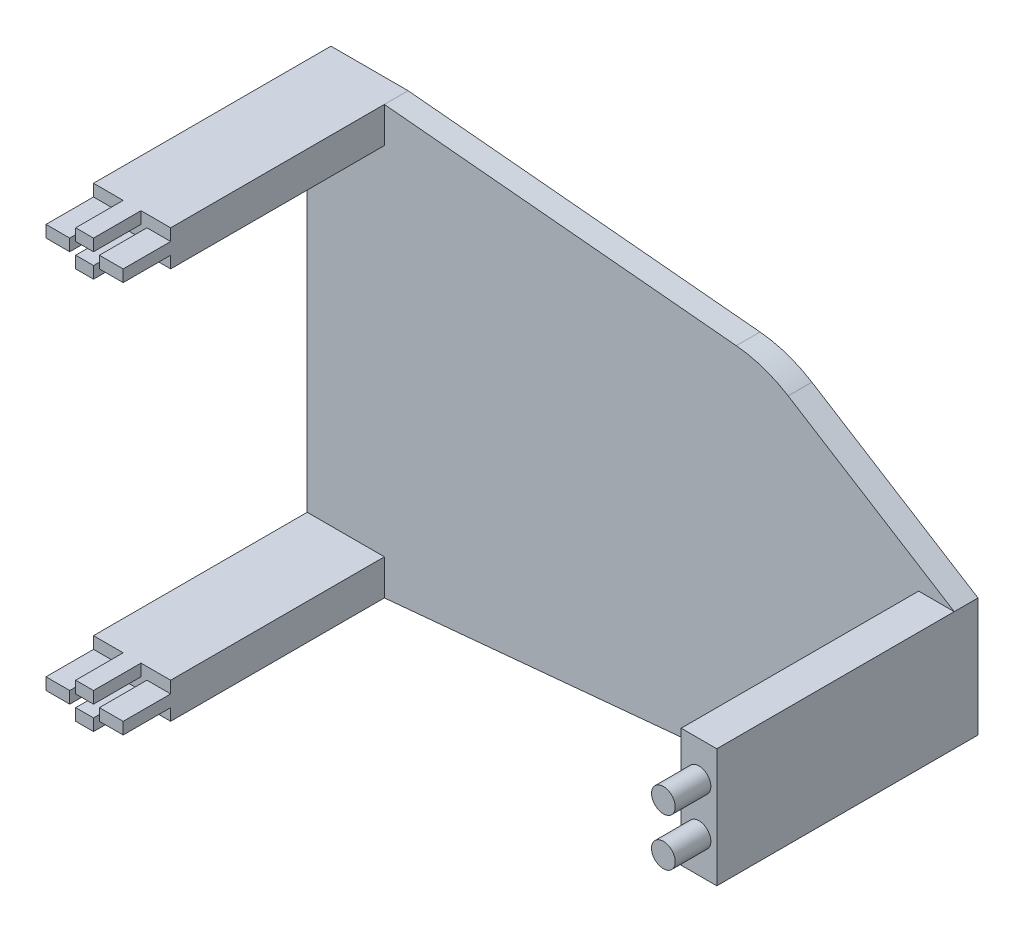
ISO-10303-21;
HEADER;
FILE_DESCRIPTION(('STEP AP214'),'2;1');
FILE_NAME('part.step','',(''),(''),'','','');
FILE_SCHEMA(('AUTOMOTIVE_DESIGN { 1 0 10303 214 1 1 1 1 }'));
ENDSEC;
DATA;
#1=APPLICATION_CONTEXT('core data for automotive mechanical design processes');
#2=APPLICATION_PROTOCOL_DEFINITION('international standard','automotive_design',2000,#1);
#3=PRODUCT_CONTEXT('',#1,'mechanical');
#4=PRODUCT('Part','Part','',(#3));
#5=PRODUCT_RELATED_PRODUCT_CATEGORY('part','',(#4));
#6=PRODUCT_DEFINITION_FORMATION('','',#4);
#7=PRODUCT_DEFINITION_CONTEXT('part definition',#1,'design');
#8=PRODUCT_DEFINITION('design','',#6,#7);
#9=PRODUCT_DEFINITION_SHAPE('','',#8);
#10=(LENGTH_UNIT() NAMED_UNIT(*) SI_UNIT(.MILLI.,.METRE.));
#11=(NAMED_UNIT(*) PLANE_ANGLE_UNIT() SI_UNIT($,.RADIAN.));
#12=(NAMED_UNIT(*) SI_UNIT($,.STERADIAN.) SOLID_ANGLE_UNIT());
#13=UNCERTAINTY_MEASURE_WITH_UNIT(LENGTH_MEASURE(1.E-05),#10,'distance_accuracy_value','');
#14=(GEOMETRIC_REPRESENTATION_CONTEXT(3) GLOBAL_UNCERTAINTY_ASSIGNED_CONTEXT((#13)) GLOBAL_UNIT_ASSIGNED_CONTEXT((#10,
#11,#12)) REPRESENTATION_CONTEXT('',''));
#15=CARTESIAN_POINT('',(0.,0.,0.));
#16=DIRECTION('',(0.,0.,1.));
#17=DIRECTION('',(1.,0.,0.));
#18=AXIS2_PLACEMENT_3D('',#15,#16,#17);
#19=CARTESIAN_POINT('',(-12.75,-15.,20.));
#20=DIRECTION('',(-1.,0.,0.));
#21=DIRECTION('',(0.,-1.,0.));
#22=AXIS2_PLACEMENT_3D('',#19,#20,#21);
#23=PLANE('',#22);
#24=DIRECTION('',(0.,-1.,0.));
#25=VECTOR('',#24,1.);
#26=CARTESIAN_POINT('',(-12.75,-18.,2.));
#27=LINE('',#26,#25);
#28=CARTESIAN_POINT('',(-12.75,-15.,2.));
#29=VERTEX_POINT('',#28);
#30=CARTESIAN_POINT('',(-12.75,-18.,2.));
#31=VERTEX_POINT('',#30);
#32=EDGE_CURVE('E358',#29,#31,#27,.T.);
#33=ORIENTED_EDGE('',*,*,#32,.F.);
#34=DIRECTION('',(0.,0.,-1.));
#35=VECTOR('',#34,1.);
#36=CARTESIAN_POINT('',(-12.75,-15.,20.));
#37=LINE('',#36,#35);
#38=CARTESIAN_POINT('',(-12.75,-15.,20.));
#39=VERTEX_POINT('',#38);
#40=EDGE_CURVE('E364',#39,#29,#37,.T.);
#41=ORIENTED_EDGE('',*,*,#40,.F.);
#42=DIRECTION('',(0.,1.,0.));
#43=VECTOR('',#42,1.);
#44=CARTESIAN_POINT('',(-12.75,-15.,20.));
#45=LINE('',#44,#43);
#46=CARTESIAN_POINT('',(-12.75,-16.,20.));
#47=VERTEX_POINT('',#46);
#48=EDGE_CURVE('E675',#47,#39,#45,.T.);
#49=ORIENTED_EDGE('',*,*,#48,.F.);
#50=DIRECTION('',(0.,0.,-1.));
#51=VECTOR('',#50,1.);
#52=CARTESIAN_POINT('',(-12.75,-16.,24.));
#53=LINE('',#52,#51);
#54=CARTESIAN_POINT('',(-12.75,-16.,24.));
#55=VERTEX_POINT('',#54);
#56=EDGE_CURVE('E481',#55,#47,#53,.T.);
#57=ORIENTED_EDGE('',*,*,#56,.F.);
#58=DIRECTION('',(0.,-1.,0.));
#59=VECTOR('',#58,1.);
#60=CARTESIAN_POINT('',(-12.75,0.,24.));
#61=LINE('',#60,#59);
#62=CARTESIAN_POINT('',(-12.75,-17.,24.));
#63=VERTEX_POINT('',#62);
#64=EDGE_CURVE('E466',#55,#63,#61,.T.);
#65=ORIENTED_EDGE('',*,*,#64,.T.);
#66=DIRECTION('',(0.,0.,-1.));
#67=VECTOR('',#66,1.);
#68=CARTESIAN_POINT('',(-12.75,-17.,24.));
#69=LINE('',#68,#67);
#70=CARTESIAN_POINT('',(-12.75,-17.,20.));
#71=VERTEX_POINT('',#70);
#72=EDGE_CURVE('E484',#63,#71,#69,.T.);
#73=ORIENTED_EDGE('',*,*,#72,.T.);
#74=CARTESIAN_POINT('',(-12.75,-18.,20.));
#75=VERTEX_POINT('',#74);
#76=EDGE_CURVE('E361',#75,#71,#45,.T.);
#77=ORIENTED_EDGE('',*,*,#76,.F.);
#78=DIRECTION('',(0.,0.,-1.));
#79=VECTOR('',#78,1.);
#80=CARTESIAN_POINT('',(-12.75,-18.,20.));
#81=LINE('',#80,#79);
#82=EDGE_CURVE('E354',#75,#31,#81,.T.);
#83=ORIENTED_EDGE('',*,*,#82,.T.);
#84=EDGE_LOOP('',(#33,#41,#49,#57,#65,#73,#77,#83));
#85=FACE_BOUND('',#84,.T.);
#86=ADVANCED_FACE('F36',(#85),#23,.F.);
#87=CARTESIAN_POINT('',(0.,0.,2.));
#88=DIRECTION('',(0.,0.,1.));
#89=DIRECTION('',(1.,0.,0.));
#90=AXIS2_PLACEMENT_3D('',#87,#88,#89);
#91=PLANE('',#90);
#92=DIRECTION('',(0.847998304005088,-0.52999894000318,0.));
#93=VECTOR('',#92,1.);
#94=CARTESIAN_POINT('',(12.1488764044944,19.438202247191,2.));
#95=LINE('',#94,#93);
#96=CARTESIAN_POINT('',(21.2584557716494,13.7447151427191,2.));
#97=VERTEX_POINT('',#96);
#98=CARTESIAN_POINT('',(35.25,5.,2.));
#99=VERTEX_POINT('',#98);
#100=EDGE_CURVE('E717',#97,#99,#95,.T.);
#101=ORIENTED_EDGE('',*,*,#100,.F.);
#102=CARTESIAN_POINT('',(15.9584663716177,5.26473210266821,2.));
#103=DIRECTION('',(0.,0.,1.));
#104=DIRECTION('',(1.,0.,0.));
#105=AXIS2_PLACEMENT_3D('',#102,#103,#104);
#106=CIRCLE('',#105,10.);
#107=CARTESIAN_POINT('',(16.8918734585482,15.2210743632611,2.));
#108=VERTEX_POINT('',#107);
#109=EDGE_CURVE('E754',#97,#108,#106,.T.);
#110=ORIENTED_EDGE('',*,*,#109,.T.);
#111=DIRECTION('',(-0.995634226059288,0.0933407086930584,0.));
#112=VECTOR('',#111,1.);
#113=CARTESIAN_POINT('',(-12.75,18.,2.));
#114=LINE('',#113,#112);
#115=CARTESIAN_POINT('',(-12.75,18.,2.));
#116=VERTEX_POINT('',#115);
#117=EDGE_CURVE('E390',#108,#116,#114,.T.);
#118=ORIENTED_EDGE('',*,*,#117,.T.);
#119=DIRECTION('',(0.,-1.,0.));
#120=VECTOR('',#119,1.);
#121=CARTESIAN_POINT('',(-12.75,15.,2.));
#122=LINE('',#121,#120);
#123=CARTESIAN_POINT('',(-12.75,15.,2.));
#124=VERTEX_POINT('',#123);
#125=EDGE_CURVE('E373',#116,#124,#122,.T.);
#126=ORIENTED_EDGE('',*,*,#125,.T.);
#127=DIRECTION('',(-1.,0.,0.));
#128=VECTOR('',#127,1.);
#129=CARTESIAN_POINT('',(0.,15.,2.));
#130=LINE('',#129,#128);
#131=CARTESIAN_POINT('',(-19.25,15.,2.));
#132=VERTEX_POINT('',#131);
#133=EDGE_CURVE('E720',#124,#132,#130,.T.);
#134=ORIENTED_EDGE('',*,*,#133,.T.);
#135=DIRECTION('',(0.,-1.,0.));
#136=VECTOR('',#135,1.);
#137=CARTESIAN_POINT('',(-19.25,0.,2.));
#138=LINE('',#137,#136);
#139=CARTESIAN_POINT('',(-19.25,-15.,2.));
#140=VERTEX_POINT('',#139);
#141=EDGE_CURVE('E722',#132,#140,#138,.T.);
#142=ORIENTED_EDGE('',*,*,#141,.T.);
#143=DIRECTION('',(-1.,0.,0.));
#144=VECTOR('',#143,1.);
#145=CARTESIAN_POINT('',(0.,-15.,2.));
#146=LINE('',#145,#144);
#147=EDGE_CURVE('E383',#29,#140,#146,.T.);
#148=ORIENTED_EDGE('',*,*,#147,.F.);
#149=ORIENTED_EDGE('',*,*,#32,.T.);
#150=DIRECTION('',(0.995634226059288,0.0933407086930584,0.));
#151=VECTOR('',#150,1.);
#152=CARTESIAN_POINT('',(19.25,-15.,2.));
#153=LINE('',#152,#151);
#154=CARTESIAN_POINT('',(16.8918734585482,-15.2210743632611,2.));
#155=VERTEX_POINT('',#154);
#156=EDGE_CURVE('E376',#31,#155,#153,.T.);
#157=ORIENTED_EDGE('',*,*,#156,.T.);
#158=CARTESIAN_POINT('',(15.9584663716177,-5.26473210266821,2.));
#159=DIRECTION('',(0.,0.,1.));
#160=DIRECTION('',(1.,0.,0.));
#161=AXIS2_PLACEMENT_3D('',#158,#159,#160);
#162=CIRCLE('',#161,10.);
#163=CARTESIAN_POINT('',(21.2584557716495,-13.7447151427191,2.));
#164=VERTEX_POINT('',#163);
#165=EDGE_CURVE('E51',#155,#164,#162,.T.);
#166=ORIENTED_EDGE('',*,*,#165,.T.);
#167=DIRECTION('',(-0.847998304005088,-0.52999894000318,0.));
#168=VECTOR('',#167,1.);
#169=CARTESIAN_POINT('',(12.1488764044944,-19.438202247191,2.));
#170=LINE('',#169,#168);
#171=CARTESIAN_POINT('',(35.25,-5.,2.));
#172=VERTEX_POINT('',#171);
#173=EDGE_CURVE('E715',#172,#164,#170,.T.);
#174=ORIENTED_EDGE('',*,*,#173,.F.);
#175=DIRECTION('',(1.,0.,0.));
#176=VECTOR('',#175,1.);
#177=CARTESIAN_POINT('',(35.25,-5.,2.));
#178=LINE('',#177,#176);
#179=CARTESIAN_POINT('',(32.25,-5.,2.));
#180=VERTEX_POINT('',#179);
#181=EDGE_CURVE('E406',#180,#172,#178,.T.);
#182=ORIENTED_EDGE('',*,*,#181,.F.);
#183=DIRECTION('',(0.,-1.,0.));
#184=VECTOR('',#183,1.);
#185=CARTESIAN_POINT('',(32.25,5.,2.));
#186=LINE('',#185,#184);
#187=CARTESIAN_POINT('',(32.25,5.,2.));
#188=VERTEX_POINT('',#187);
#189=EDGE_CURVE('E414',#188,#180,#186,.T.);
#190=ORIENTED_EDGE('',*,*,#189,.F.);
#191=DIRECTION('',(-1.,0.,0.));
#192=VECTOR('',#191,1.);
#193=CARTESIAN_POINT('',(35.25,5.,2.));
#194=LINE('',#193,#192);
#195=EDGE_CURVE('E401',#99,#188,#194,.T.);
#196=ORIENTED_EDGE('',*,*,#195,.F.);
#197=EDGE_LOOP('',(#101,#110,#118,#126,#134,#142,#148,#149,#157,#166,#174,#182,#190,#196));
#198=FACE_BOUND('',#197,.T.);
#199=ADVANCED_FACE('F381',(#198),#91,.T.);
#200=CARTESIAN_POINT('',(0.,0.,20.));
#201=DIRECTION('',(0.,0.,1.));
#202=DIRECTION('',(1.,0.,0.));
#203=AXIS2_PLACEMENT_3D('',#200,#201,#202);
#204=PLANE('',#203);
#205=DIRECTION('',(-1.,0.,0.));
#206=VECTOR('',#205,1.);
#207=CARTESIAN_POINT('',(-19.25,-15.,20.));
#208=LINE('',#207,#206);
#209=CARTESIAN_POINT('',(-15.25,-15.,20.));
#210=VERTEX_POINT('',#209);
#211=EDGE_CURVE('E678',#39,#210,#208,.T.);
#212=ORIENTED_EDGE('',*,*,#211,.T.);
#213=DIRECTION('',(0.,1.,0.));
#214=VECTOR('',#213,1.);
#215=CARTESIAN_POINT('',(-15.25,0.,20.));
#216=LINE('',#215,#214);
#217=CARTESIAN_POINT('',(-15.25,-16.,20.));
#218=VERTEX_POINT('',#217);
#219=EDGE_CURVE('E443',#218,#210,#216,.T.);
#220=ORIENTED_EDGE('',*,*,#219,.F.);
#221=DIRECTION('',(-1.,0.,0.));
#222=VECTOR('',#221,1.);
#223=CARTESIAN_POINT('',(0.,-16.,20.));
#224=LINE('',#223,#222);
#225=CARTESIAN_POINT('',(-16.75,-16.,20.));
#226=VERTEX_POINT('',#225);
#227=EDGE_CURVE('E428',#218,#226,#224,.T.);
#228=ORIENTED_EDGE('',*,*,#227,.T.);
#229=DIRECTION('',(0.,1.,0.));
#230=VECTOR('',#229,1.);
#231=CARTESIAN_POINT('',(-16.75,0.,20.));
#232=LINE('',#231,#230);
#233=CARTESIAN_POINT('',(-16.75,-15.,20.));
#234=VERTEX_POINT('',#233);
#235=EDGE_CURVE('E433',#226,#234,#232,.T.);
#236=ORIENTED_EDGE('',*,*,#235,.T.);
#237=CARTESIAN_POINT('',(-19.25,-15.,20.));
#238=VERTEX_POINT('',#237);
#239=EDGE_CURVE('E677',#234,#238,#208,.T.);
#240=ORIENTED_EDGE('',*,*,#239,.T.);
#241=DIRECTION('',(0.,-1.,0.));
#242=VECTOR('',#241,1.);
#243=CARTESIAN_POINT('',(-19.25,-15.,20.));
#244=LINE('',#243,#242);
#245=CARTESIAN_POINT('',(-19.25,-16.,20.));
#246=VERTEX_POINT('',#245);
#247=EDGE_CURVE('E668',#238,#246,#244,.T.);
#248=ORIENTED_EDGE('',*,*,#247,.T.);
#249=DIRECTION('',(-1.,0.,0.));
#250=VECTOR('',#249,1.);
#251=CARTESIAN_POINT('',(0.,-16.,20.));
#252=LINE('',#251,#250);
#253=CARTESIAN_POINT('',(-17.25,-16.,20.));
#254=VERTEX_POINT('',#253);
#255=EDGE_CURVE('E521',#254,#246,#252,.T.);
#256=ORIENTED_EDGE('',*,*,#255,.F.);
#257=DIRECTION('',(0.,1.,0.));
#258=VECTOR('',#257,1.);
#259=CARTESIAN_POINT('',(-17.25,0.,20.));
#260=LINE('',#259,#258);
#261=CARTESIAN_POINT('',(-17.25,-17.,20.));
#262=VERTEX_POINT('',#261);
#263=EDGE_CURVE('E525',#262,#254,#260,.T.);
#264=ORIENTED_EDGE('',*,*,#263,.F.);
#265=DIRECTION('',(-1.,0.,0.));
#266=VECTOR('',#265,1.);
#267=CARTESIAN_POINT('',(0.,-17.,20.));
#268=LINE('',#267,#266);
#269=CARTESIAN_POINT('',(-19.25,-17.,20.));
#270=VERTEX_POINT('',#269);
#271=EDGE_CURVE('E536',#262,#270,#268,.T.);
#272=ORIENTED_EDGE('',*,*,#271,.T.);
#273=CARTESIAN_POINT('',(-19.25,-18.,20.));
#274=VERTEX_POINT('',#273);
#275=EDGE_CURVE('E672',#270,#274,#244,.T.);
#276=ORIENTED_EDGE('',*,*,#275,.T.);
#277=DIRECTION('',(1.,0.,0.));
#278=VECTOR('',#277,1.);
#279=CARTESIAN_POINT('',(-19.25,-18.,20.));
#280=LINE('',#279,#278);
#281=CARTESIAN_POINT('',(-16.75,-18.,20.));
#282=VERTEX_POINT('',#281);
#283=EDGE_CURVE('E673',#274,#282,#280,.T.);
#284=ORIENTED_EDGE('',*,*,#283,.T.);
#285=DIRECTION('',(0.,-1.,0.));
#286=VECTOR('',#285,1.);
#287=CARTESIAN_POINT('',(-16.75,0.,20.));
#288=LINE('',#287,#286);
#289=CARTESIAN_POINT('',(-16.75,-17.,20.));
#290=VERTEX_POINT('',#289);
#291=EDGE_CURVE('E505',#290,#282,#288,.T.);
#292=ORIENTED_EDGE('',*,*,#291,.F.);
#293=DIRECTION('',(-1.,0.,0.));
#294=VECTOR('',#293,1.);
#295=CARTESIAN_POINT('',(0.,-17.,20.));
#296=LINE('',#295,#294);
#297=CARTESIAN_POINT('',(-15.25,-17.,20.));
#298=VERTEX_POINT('',#297);
#299=EDGE_CURVE('E489',#298,#290,#296,.T.);
#300=ORIENTED_EDGE('',*,*,#299,.F.);
#301=DIRECTION('',(0.,-1.,0.));
#302=VECTOR('',#301,1.);
#303=CARTESIAN_POINT('',(-15.25,0.,20.));
#304=LINE('',#303,#302);
#305=CARTESIAN_POINT('',(-15.25,-18.,20.));
#306=VERTEX_POINT('',#305);
#307=EDGE_CURVE('E494',#298,#306,#304,.T.);
#308=ORIENTED_EDGE('',*,*,#307,.T.);
#309=EDGE_CURVE('E671',#306,#75,#280,.T.);
#310=ORIENTED_EDGE('',*,*,#309,.T.);
#311=ORIENTED_EDGE('',*,*,#76,.T.);
#312=DIRECTION('',(1.,0.,0.));
#313=VECTOR('',#312,1.);
#314=CARTESIAN_POINT('',(0.,-17.,20.));
#315=LINE('',#314,#313);
#316=CARTESIAN_POINT('',(-14.75,-17.,20.));
#317=VERTEX_POINT('',#316);
#318=EDGE_CURVE('E474',#317,#71,#315,.T.);
#319=ORIENTED_EDGE('',*,*,#318,.F.);
#320=DIRECTION('',(0.,1.,0.));
#321=VECTOR('',#320,1.);
#322=CARTESIAN_POINT('',(-14.75,0.,20.));
#323=LINE('',#322,#321);
#324=CARTESIAN_POINT('',(-14.75,-16.,20.));
#325=VERTEX_POINT('',#324);
#326=EDGE_CURVE('E459',#317,#325,#323,.T.);
#327=ORIENTED_EDGE('',*,*,#326,.T.);
#328=DIRECTION('',(1.,0.,0.));
#329=VECTOR('',#328,1.);
#330=CARTESIAN_POINT('',(0.,-16.,20.));
#331=LINE('',#330,#329);
#332=EDGE_CURVE('E464',#325,#47,#331,.T.);
#333=ORIENTED_EDGE('',*,*,#332,.T.);
#334=ORIENTED_EDGE('',*,*,#48,.T.);
#335=EDGE_LOOP('',(#212,#220,#228,#236,#240,#248,#256,#264,#272,#276,#284,#292,#300,#308,#310,
#311,#319,#327,#333,#334));
#336=FACE_BOUND('',#335,.T.);
#337=ADVANCED_FACE('F890',(#336),#204,.T.);
#338=CARTESIAN_POINT('',(0.,0.,20.));
#339=DIRECTION('',(0.,0.,-1.));
#340=DIRECTION('',(-1.,0.,0.));
#341=AXIS2_PLACEMENT_3D('',#338,#339,#340);
#342=PLANE('',#341);
#343=DIRECTION('',(0.,-1.,0.));
#344=VECTOR('',#343,1.);
#345=CARTESIAN_POINT('',(-16.75,0.,20.));
#346=LINE('',#345,#344);
#347=CARTESIAN_POINT('',(-16.75,16.,20.));
#348=VERTEX_POINT('',#347);
#349=CARTESIAN_POINT('',(-16.75,15.,20.));
#350=VERTEX_POINT('',#349);
#351=EDGE_CURVE('E564',#348,#350,#346,.T.);
#352=ORIENTED_EDGE('',*,*,#351,.F.);
#353=DIRECTION('',(-1.,0.,0.));
#354=VECTOR('',#353,1.);
#355=CARTESIAN_POINT('',(0.,16.,20.));
#356=LINE('',#355,#354);
#357=CARTESIAN_POINT('',(-15.25,16.,20.));
#358=VERTEX_POINT('',#357);
#359=EDGE_CURVE('E549',#358,#348,#356,.T.);
#360=ORIENTED_EDGE('',*,*,#359,.F.);
#361=DIRECTION('',(0.,-1.,0.));
#362=VECTOR('',#361,1.);
#363=CARTESIAN_POINT('',(-15.25,0.,20.));
#364=LINE('',#363,#362);
#365=CARTESIAN_POINT('',(-15.25,15.,20.));
#366=VERTEX_POINT('',#365);
#367=EDGE_CURVE('E554',#358,#366,#364,.T.);
#368=ORIENTED_EDGE('',*,*,#367,.T.);
#369=DIRECTION('',(1.,0.,0.));
#370=VECTOR('',#369,1.);
#371=CARTESIAN_POINT('',(-19.25,15.,20.));
#372=LINE('',#371,#370);
#373=CARTESIAN_POINT('',(-12.75,15.,20.));
#374=VERTEX_POINT('',#373);
#375=EDGE_CURVE('E689',#366,#374,#372,.T.);
#376=ORIENTED_EDGE('',*,*,#375,.T.);
#377=DIRECTION('',(0.,1.,0.));
#378=VECTOR('',#377,1.);
#379=CARTESIAN_POINT('',(-12.75,15.,20.));
#380=LINE('',#379,#378);
#381=CARTESIAN_POINT('',(-12.75,16.,20.));
#382=VERTEX_POINT('',#381);
#383=EDGE_CURVE('E694',#374,#382,#380,.T.);
#384=ORIENTED_EDGE('',*,*,#383,.T.);
#385=DIRECTION('',(1.,0.,0.));
#386=VECTOR('',#385,1.);
#387=CARTESIAN_POINT('',(0.,16.,20.));
#388=LINE('',#387,#386);
#389=CARTESIAN_POINT('',(-14.75,16.,20.));
#390=VERTEX_POINT('',#389);
#391=EDGE_CURVE('E595',#390,#382,#388,.T.);
#392=ORIENTED_EDGE('',*,*,#391,.F.);
#393=DIRECTION('',(0.,-1.,0.));
#394=VECTOR('',#393,1.);
#395=CARTESIAN_POINT('',(-14.75,0.,20.));
#396=LINE('',#395,#394);
#397=CARTESIAN_POINT('',(-14.75,17.,20.));
#398=VERTEX_POINT('',#397);
#399=EDGE_CURVE('E580',#398,#390,#396,.T.);
#400=ORIENTED_EDGE('',*,*,#399,.F.);
#401=DIRECTION('',(1.,0.,0.));
#402=VECTOR('',#401,1.);
#403=CARTESIAN_POINT('',(0.,17.,20.));
#404=LINE('',#403,#402);
#405=CARTESIAN_POINT('',(-12.75,17.,20.));
#406=VERTEX_POINT('',#405);
#407=EDGE_CURVE('E585',#398,#406,#404,.T.);
#408=ORIENTED_EDGE('',*,*,#407,.T.);
#409=CARTESIAN_POINT('',(-12.75,18.,20.));
#410=VERTEX_POINT('',#409);
#411=EDGE_CURVE('E693',#406,#410,#380,.T.);
#412=ORIENTED_EDGE('',*,*,#411,.T.);
#413=DIRECTION('',(-1.,0.,0.));
#414=VECTOR('',#413,1.);
#415=CARTESIAN_POINT('',(-19.25,18.,20.));
#416=LINE('',#415,#414);
#417=CARTESIAN_POINT('',(-15.25,18.,20.));
#418=VERTEX_POINT('',#417);
#419=EDGE_CURVE('E697',#410,#418,#416,.T.);
#420=ORIENTED_EDGE('',*,*,#419,.T.);
#421=DIRECTION('',(0.,1.,0.));
#422=VECTOR('',#421,1.);
#423=CARTESIAN_POINT('',(-15.25,0.,20.));
#424=LINE('',#423,#422);
#425=CARTESIAN_POINT('',(-15.25,17.,20.));
#426=VERTEX_POINT('',#425);
#427=EDGE_CURVE('E626',#426,#418,#424,.T.);
#428=ORIENTED_EDGE('',*,*,#427,.F.);
#429=DIRECTION('',(-1.,0.,0.));
#430=VECTOR('',#429,1.);
#431=CARTESIAN_POINT('',(0.,17.,20.));
#432=LINE('',#431,#430);
#433=CARTESIAN_POINT('',(-16.75,17.,20.));
#434=VERTEX_POINT('',#433);
#435=EDGE_CURVE('E611',#426,#434,#432,.T.);
#436=ORIENTED_EDGE('',*,*,#435,.T.);
#437=DIRECTION('',(0.,1.,0.));
#438=VECTOR('',#437,1.);
#439=CARTESIAN_POINT('',(-16.75,0.,20.));
#440=LINE('',#439,#438);
#441=CARTESIAN_POINT('',(-16.75,18.,20.));
#442=VERTEX_POINT('',#441);
#443=EDGE_CURVE('E616',#434,#442,#440,.T.);
#444=ORIENTED_EDGE('',*,*,#443,.T.);
#445=CARTESIAN_POINT('',(-19.25,18.,20.));
#446=VERTEX_POINT('',#445);
#447=EDGE_CURVE('E696',#442,#446,#416,.T.);
#448=ORIENTED_EDGE('',*,*,#447,.T.);
#449=DIRECTION('',(0.,-1.,0.));
#450=VECTOR('',#449,1.);
#451=CARTESIAN_POINT('',(-19.25,15.,20.));
#452=LINE('',#451,#450);
#453=CARTESIAN_POINT('',(-19.25,17.,20.));
#454=VERTEX_POINT('',#453);
#455=EDGE_CURVE('E687',#446,#454,#452,.T.);
#456=ORIENTED_EDGE('',*,*,#455,.T.);
#457=DIRECTION('',(-1.,0.,0.));
#458=VECTOR('',#457,1.);
#459=CARTESIAN_POINT('',(0.,17.,20.));
#460=LINE('',#459,#458);
#461=CARTESIAN_POINT('',(-17.25,17.,20.));
#462=VERTEX_POINT('',#461);
#463=EDGE_CURVE('E643',#462,#454,#460,.T.);
#464=ORIENTED_EDGE('',*,*,#463,.F.);
#465=DIRECTION('',(0.,-1.,0.));
#466=VECTOR('',#465,1.);
#467=CARTESIAN_POINT('',(-17.25,0.,20.));
#468=LINE('',#467,#466);
#469=CARTESIAN_POINT('',(-17.25,16.,20.));
#470=VERTEX_POINT('',#469);
#471=EDGE_CURVE('E653',#462,#470,#468,.T.);
#472=ORIENTED_EDGE('',*,*,#471,.T.);
#473=DIRECTION('',(-1.,0.,0.));
#474=VECTOR('',#473,1.);
#475=CARTESIAN_POINT('',(0.,16.,20.));
#476=LINE('',#475,#474);
#477=CARTESIAN_POINT('',(-19.25,16.,20.));
#478=VERTEX_POINT('',#477);
#479=EDGE_CURVE('E638',#470,#478,#476,.T.);
#480=ORIENTED_EDGE('',*,*,#479,.T.);
#481=CARTESIAN_POINT('',(-19.25,15.,20.));
#482=VERTEX_POINT('',#481);
#483=EDGE_CURVE('E690',#478,#482,#452,.T.);
#484=ORIENTED_EDGE('',*,*,#483,.T.);
#485=EDGE_CURVE('E691',#482,#350,#372,.T.);
#486=ORIENTED_EDGE('',*,*,#485,.T.);
#487=EDGE_LOOP('',(#352,#360,#368,#376,#384,#392,#400,#408,#412,#420,#428,#436,#444,#448,#456,
#464,#472,#480,#484,#486));
#488=FACE_BOUND('',#487,.T.);
#489=ADVANCED_FACE('F808',(#488),#342,.F.);
#490=CARTESIAN_POINT('',(12.1488764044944,-19.438202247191,2.));
#491=DIRECTION('',(0.52999894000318,-0.847998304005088,0.));
#492=DIRECTION('',(0.847998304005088,0.52999894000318,0.));
#493=AXIS2_PLACEMENT_3D('',#490,#491,#492);
#494=PLANE('',#493);
#495=ORIENTED_EDGE('',*,*,#173,.T.);
#496=DIRECTION('',(0.,0.,-1.));
#497=VECTOR('',#496,1.);
#498=CARTESIAN_POINT('',(21.2584557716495,-13.7447151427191,2.));
#499=LINE('',#498,#497);
#500=CARTESIAN_POINT('',(21.2584557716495,-13.7447151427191,0.));
#501=VERTEX_POINT('',#500);
#502=EDGE_CURVE('E44',#164,#501,#499,.T.);
#503=ORIENTED_EDGE('',*,*,#502,.T.);
#504=DIRECTION('',(-0.847998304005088,-0.52999894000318,0.));
#505=VECTOR('',#504,1.);
#506=CARTESIAN_POINT('',(12.1488764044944,-19.438202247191,0.));
#507=LINE('',#506,#505);
#508=CARTESIAN_POINT('',(35.25,-5.,0.));
#509=VERTEX_POINT('',#508);
#510=EDGE_CURVE('E714',#509,#501,#507,.T.);
#511=ORIENTED_EDGE('',*,*,#510,.F.);
#512=DIRECTION('',(0.,0.,-1.));
#513=VECTOR('',#512,1.);
#514=CARTESIAN_POINT('',(35.25,-5.,2.));
#515=LINE('',#514,#513);
#516=EDGE_CURVE('E736',#172,#509,#515,.T.);
#517=ORIENTED_EDGE('',*,*,#516,.F.);
#518=EDGE_LOOP('',(#495,#503,#511,#517));
#519=FACE_BOUND('',#518,.T.);
#520=ADVANCED_FACE('F759',(#519),#494,.T.);
#521=CARTESIAN_POINT('',(35.25,0.,2.));
#522=DIRECTION('',(1.,0.,0.));
#523=DIRECTION('',(0.,0.,-1.));
#524=AXIS2_PLACEMENT_3D('',#521,#522,#523);
#525=PLANE('',#524);
#526=DIRECTION('',(0.,-1.,0.));
#527=VECTOR('',#526,1.);
#528=CARTESIAN_POINT('',(35.25,0.,0.));
#529=LINE('',#528,#527);
#530=CARTESIAN_POINT('',(35.25,5.,0.));
#531=VERTEX_POINT('',#530);
#532=EDGE_CURVE('E728',#531,#509,#529,.T.);
#533=ORIENTED_EDGE('',*,*,#532,.F.);
#534=DIRECTION('',(0.,0.,-1.));
#535=VECTOR('',#534,1.);
#536=CARTESIAN_POINT('',(35.25,5.,2.));
#537=LINE('',#536,#535);
#538=EDGE_CURVE('E725',#99,#531,#537,.T.);
#539=ORIENTED_EDGE('',*,*,#538,.F.);
#540=DIRECTION('',(0.,0.,-1.));
#541=VECTOR('',#540,1.);
#542=CARTESIAN_POINT('',(35.25,5.,22.));
#543=LINE('',#542,#541);
#544=CARTESIAN_POINT('',(35.25,5.,22.));
#545=VERTEX_POINT('',#544);
#546=EDGE_CURVE('E425',#545,#99,#543,.T.);
#547=ORIENTED_EDGE('',*,*,#546,.F.);
#548=DIRECTION('',(0.,1.,0.));
#549=VECTOR('',#548,1.);
#550=CARTESIAN_POINT('',(35.25,5.,22.));
#551=LINE('',#550,#549);
#552=CARTESIAN_POINT('',(35.25,-5.,22.));
#553=VERTEX_POINT('',#552);
#554=EDGE_CURVE('E402',#553,#545,#551,.T.);
#555=ORIENTED_EDGE('',*,*,#554,.F.);
#556=DIRECTION('',(0.,0.,-1.));
#557=VECTOR('',#556,1.);
#558=CARTESIAN_POINT('',(35.25,-5.,22.));
#559=LINE('',#558,#557);
#560=EDGE_CURVE('E412',#553,#172,#559,.T.);
#561=ORIENTED_EDGE('',*,*,#560,.T.);
#562=ORIENTED_EDGE('',*,*,#516,.T.);
#563=EDGE_LOOP('',(#533,#539,#547,#555,#561,#562));
#564=FACE_BOUND('',#563,.T.);
#565=ADVANCED_FACE('F769',(#564),#525,.T.);
#566=CARTESIAN_POINT('',(12.1488764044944,19.438202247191,2.));
#567=DIRECTION('',(0.52999894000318,0.847998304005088,0.));
#568=DIRECTION('',(-0.847998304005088,0.52999894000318,0.));
#569=AXIS2_PLACEMENT_3D('',#566,#567,#568);
#570=PLANE('',#569);
#571=DIRECTION('',(0.847998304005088,-0.52999894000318,0.));
#572=VECTOR('',#571,1.);
#573=CARTESIAN_POINT('',(12.1488764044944,19.438202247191,0.));
#574=LINE('',#573,#572);
#575=CARTESIAN_POINT('',(21.2584557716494,13.7447151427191,0.));
#576=VERTEX_POINT('',#575);
#577=EDGE_CURVE('E731',#576,#531,#574,.T.);
#578=ORIENTED_EDGE('',*,*,#577,.F.);
#579=DIRECTION('',(0.,0.,-1.));
#580=VECTOR('',#579,1.);
#581=CARTESIAN_POINT('',(21.2584557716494,13.7447151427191,2.));
#582=LINE('',#581,#580);
#583=EDGE_CURVE('E751',#576,#97,#582,.F.);
#584=ORIENTED_EDGE('',*,*,#583,.T.);
#585=ORIENTED_EDGE('',*,*,#100,.T.);
#586=ORIENTED_EDGE('',*,*,#538,.T.);
#587=EDGE_LOOP('',(#578,#584,#585,#586));
#588=FACE_BOUND('',#587,.T.);
#589=ADVANCED_FACE('F910',(#588),#570,.T.);
#590=CARTESIAN_POINT('',(-19.25,0.,2.));
#591=DIRECTION('',(1.,0.,0.));
#592=DIRECTION('',(0.,0.,-1.));
#593=AXIS2_PLACEMENT_3D('',#590,#591,#592);
#594=PLANE('',#593);
#595=DIRECTION('',(0.,-1.,0.));
#596=VECTOR('',#595,1.);
#597=CARTESIAN_POINT('',(-19.25,0.,0.));
#598=LINE('',#597,#596);
#599=CARTESIAN_POINT('',(-19.25,18.,0.));
#600=VERTEX_POINT('',#599);
#601=CARTESIAN_POINT('',(-19.25,-18.,0.));
#602=VERTEX_POINT('',#601);
#603=EDGE_CURVE('E718',#600,#602,#598,.T.);
#604=ORIENTED_EDGE('',*,*,#603,.T.);
#605=DIRECTION('',(0.,0.,-1.));
#606=VECTOR('',#605,1.);
#607=CARTESIAN_POINT('',(-19.25,-18.,20.));
#608=LINE('',#607,#606);
#609=EDGE_CURVE('E363',#274,#602,#608,.T.);
#610=ORIENTED_EDGE('',*,*,#609,.F.);
#611=ORIENTED_EDGE('',*,*,#275,.F.);
#612=DIRECTION('',(0.,0.,-1.));
#613=VECTOR('',#612,1.);
#614=CARTESIAN_POINT('',(-19.25,-17.,24.));
#615=LINE('',#614,#613);
#616=CARTESIAN_POINT('',(-19.25,-17.,24.));
#617=VERTEX_POINT('',#616);
#618=EDGE_CURVE('E545',#617,#270,#615,.T.);
#619=ORIENTED_EDGE('',*,*,#618,.F.);
#620=DIRECTION('',(0.,1.,0.));
#621=VECTOR('',#620,1.);
#622=CARTESIAN_POINT('',(-19.25,0.,24.));
#623=LINE('',#622,#621);
#624=CARTESIAN_POINT('',(-19.25,-16.,24.));
#625=VERTEX_POINT('',#624);
#626=EDGE_CURVE('E524',#617,#625,#623,.T.);
#627=ORIENTED_EDGE('',*,*,#626,.T.);
#628=DIRECTION('',(0.,0.,-1.));
#629=VECTOR('',#628,1.);
#630=CARTESIAN_POINT('',(-19.25,-16.,24.));
#631=LINE('',#630,#629);
#632=EDGE_CURVE('E547',#625,#246,#631,.T.);
#633=ORIENTED_EDGE('',*,*,#632,.T.);
#634=ORIENTED_EDGE('',*,*,#247,.F.);
#635=DIRECTION('',(0.,0.,-1.));
#636=VECTOR('',#635,1.);
#637=CARTESIAN_POINT('',(-19.25,-15.,20.));
#638=LINE('',#637,#636);
#639=EDGE_CURVE('E680',#238,#140,#638,.T.);
#640=ORIENTED_EDGE('',*,*,#639,.T.);
#641=ORIENTED_EDGE('',*,*,#141,.F.);
#642=DIRECTION('',(0.,0.,-1.));
#643=VECTOR('',#642,1.);
#644=CARTESIAN_POINT('',(-19.25,15.,20.));
#645=LINE('',#644,#643);
#646=EDGE_CURVE('E711',#482,#132,#645,.T.);
#647=ORIENTED_EDGE('',*,*,#646,.F.);
#648=ORIENTED_EDGE('',*,*,#483,.F.);
#649=DIRECTION('',(0.,0.,-1.));
#650=VECTOR('',#649,1.);
#651=CARTESIAN_POINT('',(-19.25,16.,24.));
#652=LINE('',#651,#650);
#653=CARTESIAN_POINT('',(-19.25,16.,24.));
#654=VERTEX_POINT('',#653);
#655=EDGE_CURVE('E650',#654,#478,#652,.T.);
#656=ORIENTED_EDGE('',*,*,#655,.F.);
#657=DIRECTION('',(0.,-1.,0.));
#658=VECTOR('',#657,1.);
#659=CARTESIAN_POINT('',(-19.25,0.,24.));
#660=LINE('',#659,#658);
#661=CARTESIAN_POINT('',(-19.25,17.,24.));
#662=VERTEX_POINT('',#661);
#663=EDGE_CURVE('E648',#662,#654,#660,.T.);
#664=ORIENTED_EDGE('',*,*,#663,.F.);
#665=DIRECTION('',(0.,0.,-1.));
#666=VECTOR('',#665,1.);
#667=CARTESIAN_POINT('',(-19.25,17.,24.));
#668=LINE('',#667,#666);
#669=EDGE_CURVE('E659',#662,#454,#668,.T.);
#670=ORIENTED_EDGE('',*,*,#669,.T.);
#671=ORIENTED_EDGE('',*,*,#455,.F.);
#672=DIRECTION('',(0.,0.,-1.));
#673=VECTOR('',#672,1.);
#674=CARTESIAN_POINT('',(-19.25,18.,20.));
#675=LINE('',#674,#673);
#676=EDGE_CURVE('E700',#446,#600,#675,.T.);
#677=ORIENTED_EDGE('',*,*,#676,.T.);
#678=EDGE_LOOP('',(#604,#610,#611,#619,#627,#633,#634,#640,#641,#647,#648,#656,#664,#670,#671,#677));
#679=FACE_BOUND('',#678,.T.);
#680=ADVANCED_FACE('F803',(#679),#594,.F.);
#681=CARTESIAN_POINT('',(0.,0.,0.));
#682=DIRECTION('',(0.,0.,1.));
#683=DIRECTION('',(1.,0.,0.));
#684=AXIS2_PLACEMENT_3D('',#681,#682,#683);
#685=PLANE('',#684);
#686=DIRECTION('',(-0.995634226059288,0.0933407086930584,0.));
#687=VECTOR('',#686,1.);
#688=CARTESIAN_POINT('',(-12.75,18.,0.));
#689=LINE('',#688,#687);
#690=CARTESIAN_POINT('',(16.8918734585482,15.2210743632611,0.));
#691=VERTEX_POINT('',#690);
#692=CARTESIAN_POINT('',(-12.75,18.,0.));
#693=VERTEX_POINT('',#692);
#694=EDGE_CURVE('E387',#691,#693,#689,.T.);
#695=ORIENTED_EDGE('',*,*,#694,.F.);
#696=CARTESIAN_POINT('',(15.9584663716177,5.26473210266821,0.));
#697=DIRECTION('',(0.,0.,1.));
#698=DIRECTION('',(1.,0.,0.));
#699=AXIS2_PLACEMENT_3D('',#696,#697,#698);
#700=CIRCLE('',#699,10.);
#701=EDGE_CURVE('E749',#691,#576,#700,.F.);
#702=ORIENTED_EDGE('',*,*,#701,.T.);
#703=ORIENTED_EDGE('',*,*,#577,.T.);
#704=ORIENTED_EDGE('',*,*,#532,.T.);
#705=ORIENTED_EDGE('',*,*,#510,.T.);
#706=CARTESIAN_POINT('',(15.9584663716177,-5.26473210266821,0.));
#707=DIRECTION('',(0.,0.,1.));
#708=DIRECTION('',(1.,0.,0.));
#709=AXIS2_PLACEMENT_3D('',#706,#707,#708);
#710=CIRCLE('',#709,10.);
#711=CARTESIAN_POINT('',(16.8918734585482,-15.2210743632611,0.));
#712=VERTEX_POINT('',#711);
#713=EDGE_CURVE('E747',#501,#712,#710,.F.);
#714=ORIENTED_EDGE('',*,*,#713,.T.);
#715=DIRECTION('',(0.995634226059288,0.0933407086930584,0.));
#716=VECTOR('',#715,1.);
#717=CARTESIAN_POINT('',(19.25,-15.,0.));
#718=LINE('',#717,#716);
#719=CARTESIAN_POINT('',(-12.75,-18.,0.));
#720=VERTEX_POINT('',#719);
#721=EDGE_CURVE('E374',#720,#712,#718,.T.);
#722=ORIENTED_EDGE('',*,*,#721,.F.);
#723=DIRECTION('',(1.,0.,0.));
#724=VECTOR('',#723,1.);
#725=CARTESIAN_POINT('',(-19.25,-18.,0.));
#726=LINE('',#725,#724);
#727=EDGE_CURVE('E371',#602,#720,#726,.T.);
#728=ORIENTED_EDGE('',*,*,#727,.F.);
#729=ORIENTED_EDGE('',*,*,#603,.F.);
#730=DIRECTION('',(-1.,0.,0.));
#731=VECTOR('',#730,1.);
#732=CARTESIAN_POINT('',(-19.25,18.,0.));
#733=LINE('',#732,#731);
#734=EDGE_CURVE('E686',#693,#600,#733,.T.);
#735=ORIENTED_EDGE('',*,*,#734,.F.);
#736=EDGE_LOOP('',(#695,#702,#703,#704,#705,#714,#722,#728,#729,#735));
#737=FACE_BOUND('',#736,.T.);
#738=ADVANCED_FACE('F764',(#737),#685,.F.);
#739=CARTESIAN_POINT('',(-19.25,15.,20.));
#740=DIRECTION('',(0.,1.,0.));
#741=DIRECTION('',(0.,0.,1.));
#742=AXIS2_PLACEMENT_3D('',#739,#740,#741);
#743=PLANE('',#742);
#744=ORIENTED_EDGE('',*,*,#133,.F.);
#745=DIRECTION('',(0.,0.,-1.));
#746=VECTOR('',#745,1.);
#747=CARTESIAN_POINT('',(-12.75,15.,20.));
#748=LINE('',#747,#746);
#749=EDGE_CURVE('E708',#374,#124,#748,.T.);
#750=ORIENTED_EDGE('',*,*,#749,.F.);
#751=ORIENTED_EDGE('',*,*,#375,.F.);
#752=DIRECTION('',(0.,0.,-1.));
#753=VECTOR('',#752,1.);
#754=CARTESIAN_POINT('',(-15.25,15.,24.));
#755=LINE('',#754,#753);
#756=CARTESIAN_POINT('',(-15.25,15.,24.));
#757=VERTEX_POINT('',#756);
#758=EDGE_CURVE('E571',#757,#366,#755,.T.);
#759=ORIENTED_EDGE('',*,*,#758,.F.);
#760=DIRECTION('',(1.,0.,0.));
#761=VECTOR('',#760,1.);
#762=CARTESIAN_POINT('',(0.,15.,24.));
#763=LINE('',#762,#761);
#764=CARTESIAN_POINT('',(-16.75,15.,24.));
#765=VERTEX_POINT('',#764);
#766=EDGE_CURVE('E556',#765,#757,#763,.T.);
#767=ORIENTED_EDGE('',*,*,#766,.F.);
#768=DIRECTION('',(0.,0.,-1.));
#769=VECTOR('',#768,1.);
#770=CARTESIAN_POINT('',(-16.75,15.,24.));
#771=LINE('',#770,#769);
#772=EDGE_CURVE('E574',#765,#350,#771,.T.);
#773=ORIENTED_EDGE('',*,*,#772,.T.);
#774=ORIENTED_EDGE('',*,*,#485,.F.);
#775=ORIENTED_EDGE('',*,*,#646,.T.);
#776=EDGE_LOOP('',(#744,#750,#751,#759,#767,#773,#774,#775));
#777=FACE_BOUND('',#776,.T.);
#778=ADVANCED_FACE('F826',(#777),#743,.F.);
#779=CARTESIAN_POINT('',(-12.75,15.,20.));
#780=DIRECTION('',(-1.,0.,0.));
#781=DIRECTION('',(0.,0.,1.));
#782=AXIS2_PLACEMENT_3D('',#779,#780,#781);
#783=PLANE('',#782);
#784=ORIENTED_EDGE('',*,*,#749,.T.);
#785=ORIENTED_EDGE('',*,*,#125,.F.);
#786=DIRECTION('',(0.,0.,-1.));
#787=VECTOR('',#786,1.);
#788=CARTESIAN_POINT('',(-12.75,18.,20.));
#789=LINE('',#788,#787);
#790=EDGE_CURVE('E705',#410,#116,#789,.T.);
#791=ORIENTED_EDGE('',*,*,#790,.F.);
#792=ORIENTED_EDGE('',*,*,#411,.F.);
#793=DIRECTION('',(0.,0.,-1.));
#794=VECTOR('',#793,1.);
#795=CARTESIAN_POINT('',(-12.75,17.,24.));
#796=LINE('',#795,#794);
#797=CARTESIAN_POINT('',(-12.75,17.,24.));
#798=VERTEX_POINT('',#797);
#799=EDGE_CURVE('E602',#798,#406,#796,.T.);
#800=ORIENTED_EDGE('',*,*,#799,.F.);
#801=DIRECTION('',(0.,1.,0.));
#802=VECTOR('',#801,1.);
#803=CARTESIAN_POINT('',(-12.75,0.,24.));
#804=LINE('',#803,#802);
#805=CARTESIAN_POINT('',(-12.75,16.,24.));
#806=VERTEX_POINT('',#805);
#807=EDGE_CURVE('E587',#806,#798,#804,.T.);
#808=ORIENTED_EDGE('',*,*,#807,.F.);
#809=DIRECTION('',(0.,0.,-1.));
#810=VECTOR('',#809,1.);
#811=CARTESIAN_POINT('',(-12.75,16.,24.));
#812=LINE('',#811,#810);
#813=EDGE_CURVE('E605',#806,#382,#812,.T.);
#814=ORIENTED_EDGE('',*,*,#813,.T.);
#815=ORIENTED_EDGE('',*,*,#383,.F.);
#816=EDGE_LOOP('',(#784,#785,#791,#792,#800,#808,#814,#815));
#817=FACE_BOUND('',#816,.T.);
#818=ADVANCED_FACE('F844',(#817),#783,.F.);
#819=CARTESIAN_POINT('',(-19.25,18.,20.));
#820=DIRECTION('',(0.,-1.,0.));
#821=DIRECTION('',(0.,0.,-1.));
#822=AXIS2_PLACEMENT_3D('',#819,#820,#821);
#823=PLANE('',#822);
#824=ORIENTED_EDGE('',*,*,#734,.T.);
#825=ORIENTED_EDGE('',*,*,#676,.F.);
#826=ORIENTED_EDGE('',*,*,#447,.F.);
#827=DIRECTION('',(0.,0.,-1.));
#828=VECTOR('',#827,1.);
#829=CARTESIAN_POINT('',(-16.75,18.,24.));
#830=LINE('',#829,#828);
#831=CARTESIAN_POINT('',(-16.75,18.,24.));
#832=VERTEX_POINT('',#831);
#833=EDGE_CURVE('E631',#832,#442,#830,.T.);
#834=ORIENTED_EDGE('',*,*,#833,.F.);
#835=DIRECTION('',(-1.,0.,0.));
#836=VECTOR('',#835,1.);
#837=CARTESIAN_POINT('',(0.,18.,24.));
#838=LINE('',#837,#836);
#839=CARTESIAN_POINT('',(-15.25,18.,24.));
#840=VERTEX_POINT('',#839);
#841=EDGE_CURVE('E618',#840,#832,#838,.T.);
#842=ORIENTED_EDGE('',*,*,#841,.F.);
#843=DIRECTION('',(0.,0.,-1.));
#844=VECTOR('',#843,1.);
#845=CARTESIAN_POINT('',(-15.25,18.,24.));
#846=LINE('',#845,#844);
#847=EDGE_CURVE('E633',#840,#418,#846,.T.);
#848=ORIENTED_EDGE('',*,*,#847,.T.);
#849=ORIENTED_EDGE('',*,*,#419,.F.);
#850=ORIENTED_EDGE('',*,*,#790,.T.);
#851=DIRECTION('',(0.,0.,1.));
#852=VECTOR('',#851,1.);
#853=CARTESIAN_POINT('',(-12.75,18.,0.));
#854=LINE('',#853,#852);
#855=EDGE_CURVE('E389',#693,#116,#854,.T.);
#856=ORIENTED_EDGE('',*,*,#855,.F.);
#857=EDGE_LOOP('',(#824,#825,#826,#834,#842,#848,#849,#850,#856));
#858=FACE_BOUND('',#857,.T.);
#859=ADVANCED_FACE('F799',(#858),#823,.F.);
#860=CARTESIAN_POINT('',(-19.25,-15.,20.));
#861=DIRECTION('',(0.,-1.,0.));
#862=DIRECTION('',(0.,0.,-1.));
#863=AXIS2_PLACEMENT_3D('',#860,#861,#862);
#864=PLANE('',#863);
#865=ORIENTED_EDGE('',*,*,#40,.T.);
#866=ORIENTED_EDGE('',*,*,#147,.T.);
#867=ORIENTED_EDGE('',*,*,#639,.F.);
#868=ORIENTED_EDGE('',*,*,#239,.F.);
#869=DIRECTION('',(0.,0.,-1.));
#870=VECTOR('',#869,1.);
#871=CARTESIAN_POINT('',(-16.75,-15.,24.));
#872=LINE('',#871,#870);
#873=CARTESIAN_POINT('',(-16.75,-15.,24.));
#874=VERTEX_POINT('',#873);
#875=EDGE_CURVE('E450',#874,#234,#872,.T.);
#876=ORIENTED_EDGE('',*,*,#875,.F.);
#877=DIRECTION('',(1.,0.,0.));
#878=VECTOR('',#877,1.);
#879=CARTESIAN_POINT('',(0.,-15.,24.));
#880=LINE('',#879,#878);
#881=CARTESIAN_POINT('',(-15.25,-15.,24.));
#882=VERTEX_POINT('',#881);
#883=EDGE_CURVE('E435',#874,#882,#880,.T.);
#884=ORIENTED_EDGE('',*,*,#883,.T.);
#885=DIRECTION('',(0.,0.,-1.));
#886=VECTOR('',#885,1.);
#887=CARTESIAN_POINT('',(-15.25,-15.,24.));
#888=LINE('',#887,#886);
#889=EDGE_CURVE('E453',#882,#210,#888,.T.);
#890=ORIENTED_EDGE('',*,*,#889,.T.);
#891=ORIENTED_EDGE('',*,*,#211,.F.);
#892=EDGE_LOOP('',(#865,#866,#867,#868,#876,#884,#890,#891));
#893=FACE_BOUND('',#892,.T.);
#894=ADVANCED_FACE('F894',(#893),#864,.F.);
#895=CARTESIAN_POINT('',(-19.25,-18.,20.));
#896=DIRECTION('',(0.,1.,0.));
#897=DIRECTION('',(0.,0.,1.));
#898=AXIS2_PLACEMENT_3D('',#895,#896,#897);
#899=PLANE('',#898);
#900=ORIENTED_EDGE('',*,*,#727,.T.);
#901=DIRECTION('',(0.,0.,1.));
#902=VECTOR('',#901,1.);
#903=CARTESIAN_POINT('',(-12.75,-18.,0.));
#904=LINE('',#903,#902);
#905=EDGE_CURVE('E367',#720,#31,#904,.T.);
#906=ORIENTED_EDGE('',*,*,#905,.T.);
#907=ORIENTED_EDGE('',*,*,#82,.F.);
#908=ORIENTED_EDGE('',*,*,#309,.F.);
#909=DIRECTION('',(0.,0.,-1.));
#910=VECTOR('',#909,1.);
#911=CARTESIAN_POINT('',(-15.25,-18.,24.));
#912=LINE('',#911,#910);
#913=CARTESIAN_POINT('',(-15.25,-18.,24.));
#914=VERTEX_POINT('',#913);
#915=EDGE_CURVE('E512',#914,#306,#912,.T.);
#916=ORIENTED_EDGE('',*,*,#915,.F.);
#917=DIRECTION('',(-1.,0.,0.));
#918=VECTOR('',#917,1.);
#919=CARTESIAN_POINT('',(0.,-18.,24.));
#920=LINE('',#919,#918);
#921=CARTESIAN_POINT('',(-16.75,-18.,24.));
#922=VERTEX_POINT('',#921);
#923=EDGE_CURVE('E496',#914,#922,#920,.T.);
#924=ORIENTED_EDGE('',*,*,#923,.T.);
#925=DIRECTION('',(0.,0.,-1.));
#926=VECTOR('',#925,1.);
#927=CARTESIAN_POINT('',(-16.75,-18.,24.));
#928=LINE('',#927,#926);
#929=EDGE_CURVE('E515',#922,#282,#928,.T.);
#930=ORIENTED_EDGE('',*,*,#929,.T.);
#931=ORIENTED_EDGE('',*,*,#283,.F.);
#932=ORIENTED_EDGE('',*,*,#609,.T.);
#933=EDGE_LOOP('',(#900,#906,#907,#908,#916,#924,#930,#931,#932));
#934=FACE_BOUND('',#933,.T.);
#935=ADVANCED_FACE('F368',(#934),#899,.F.);
#936=CARTESIAN_POINT('',(0.,16.,24.));
#937=DIRECTION('',(0.,-1.,0.));
#938=DIRECTION('',(0.,0.,-1.));
#939=AXIS2_PLACEMENT_3D('',#936,#937,#938);
#940=PLANE('',#939);
#941=ORIENTED_EDGE('',*,*,#479,.F.);
#942=DIRECTION('',(0.,0.,-1.));
#943=VECTOR('',#942,1.);
#944=CARTESIAN_POINT('',(-17.25,16.,24.));
#945=LINE('',#944,#943);
#946=CARTESIAN_POINT('',(-17.25,16.,24.));
#947=VERTEX_POINT('',#946);
#948=EDGE_CURVE('E665',#947,#470,#945,.T.);
#949=ORIENTED_EDGE('',*,*,#948,.F.);
#950=DIRECTION('',(-1.,0.,0.));
#951=VECTOR('',#950,1.);
#952=CARTESIAN_POINT('',(0.,16.,24.));
#953=LINE('',#952,#951);
#954=EDGE_CURVE('E639',#947,#654,#953,.T.);
#955=ORIENTED_EDGE('',*,*,#954,.T.);
#956=ORIENTED_EDGE('',*,*,#655,.T.);
#957=EDGE_LOOP('',(#941,#949,#955,#956));
#958=FACE_BOUND('',#957,.T.);
#959=ADVANCED_FACE('F820',(#958),#940,.T.);
#960=CARTESIAN_POINT('',(-17.25,0.,24.));
#961=DIRECTION('',(1.,0.,0.));
#962=DIRECTION('',(0.,0.,-1.));
#963=AXIS2_PLACEMENT_3D('',#960,#961,#962);
#964=PLANE('',#963);
#965=ORIENTED_EDGE('',*,*,#471,.F.);
#966=DIRECTION('',(0.,0.,-1.));
#967=VECTOR('',#966,1.);
#968=CARTESIAN_POINT('',(-17.25,17.,24.));
#969=LINE('',#968,#967);
#970=CARTESIAN_POINT('',(-17.25,17.,24.));
#971=VERTEX_POINT('',#970);
#972=EDGE_CURVE('E662',#971,#462,#969,.T.);
#973=ORIENTED_EDGE('',*,*,#972,.F.);
#974=DIRECTION('',(0.,-1.,0.));
#975=VECTOR('',#974,1.);
#976=CARTESIAN_POINT('',(-17.25,0.,24.));
#977=LINE('',#976,#975);
#978=EDGE_CURVE('E642',#971,#947,#977,.T.);
#979=ORIENTED_EDGE('',*,*,#978,.T.);
#980=ORIENTED_EDGE('',*,*,#948,.T.);
#981=EDGE_LOOP('',(#965,#973,#979,#980));
#982=FACE_BOUND('',#981,.T.);
#983=ADVANCED_FACE('F815',(#982),#964,.T.);
#984=CARTESIAN_POINT('',(0.,17.,24.));
#985=DIRECTION('',(0.,-1.,0.));
#986=DIRECTION('',(0.,0.,-1.));
#987=AXIS2_PLACEMENT_3D('',#984,#985,#986);
#988=PLANE('',#987);
#989=ORIENTED_EDGE('',*,*,#463,.T.);
#990=ORIENTED_EDGE('',*,*,#669,.F.);
#991=DIRECTION('',(-1.,0.,0.));
#992=VECTOR('',#991,1.);
#993=CARTESIAN_POINT('',(0.,17.,24.));
#994=LINE('',#993,#992);
#995=EDGE_CURVE('E646',#971,#662,#994,.T.);
#996=ORIENTED_EDGE('',*,*,#995,.F.);
#997=ORIENTED_EDGE('',*,*,#972,.T.);
#998=EDGE_LOOP('',(#989,#990,#996,#997));
#999=FACE_BOUND('',#998,.T.);
#1000=ADVANCED_FACE('F810',(#999),#988,.F.);
#1001=CARTESIAN_POINT('',(0.,0.,24.));
#1002=DIRECTION('',(0.,0.,1.));
#1003=DIRECTION('',(1.,0.,0.));
#1004=AXIS2_PLACEMENT_3D('',#1001,#1002,#1003);
#1005=PLANE('',#1004);
#1006=ORIENTED_EDGE('',*,*,#954,.F.);
#1007=ORIENTED_EDGE('',*,*,#978,.F.);
#1008=ORIENTED_EDGE('',*,*,#995,.T.);
#1009=ORIENTED_EDGE('',*,*,#663,.T.);
#1010=EDGE_LOOP('',(#1006,#1007,#1008,#1009));
#1011=FACE_BOUND('',#1010,.T.);
#1012=ADVANCED_FACE('F1418',(#1011),#1005,.T.);
#1013=CARTESIAN_POINT('',(0.,17.,24.));
#1014=DIRECTION('',(0.,-1.,0.));
#1015=DIRECTION('',(0.,0.,-1.));
#1016=AXIS2_PLACEMENT_3D('',#1013,#1014,#1015);
#1017=PLANE('',#1016);
#1018=ORIENTED_EDGE('',*,*,#435,.F.);
#1019=DIRECTION('',(0.,0.,-1.));
#1020=VECTOR('',#1019,1.);
#1021=CARTESIAN_POINT('',(-15.25,17.,24.));
#1022=LINE('',#1021,#1020);
#1023=CARTESIAN_POINT('',(-15.25,17.,24.));
#1024=VERTEX_POINT('',#1023);
#1025=EDGE_CURVE('E636',#1024,#426,#1022,.T.);
#1026=ORIENTED_EDGE('',*,*,#1025,.F.);
#1027=DIRECTION('',(-1.,0.,0.));
#1028=VECTOR('',#1027,1.);
#1029=CARTESIAN_POINT('',(0.,17.,24.));
#1030=LINE('',#1029,#1028);
#1031=CARTESIAN_POINT('',(-16.75,17.,24.));
#1032=VERTEX_POINT('',#1031);
#1033=EDGE_CURVE('E612',#1024,#1032,#1030,.T.);
#1034=ORIENTED_EDGE('',*,*,#1033,.T.);
#1035=DIRECTION('',(0.,0.,-1.));
#1036=VECTOR('',#1035,1.);
#1037=CARTESIAN_POINT('',(-16.75,17.,24.));
#1038=LINE('',#1037,#1036);
#1039=EDGE_CURVE('E623',#1032,#434,#1038,.T.);
#1040=ORIENTED_EDGE('',*,*,#1039,.T.);
#1041=EDGE_LOOP('',(#1018,#1026,#1034,#1040));
#1042=FACE_BOUND('',#1041,.T.);
#1043=ADVANCED_FACE('F869',(#1042),#1017,.T.);
#1044=CARTESIAN_POINT('',(-15.25,0.,24.));
#1045=DIRECTION('',(-1.,0.,0.));
#1046=DIRECTION('',(0.,0.,1.));
#1047=AXIS2_PLACEMENT_3D('',#1044,#1045,#1046);
#1048=PLANE('',#1047);
#1049=ORIENTED_EDGE('',*,*,#427,.T.);
#1050=ORIENTED_EDGE('',*,*,#847,.F.);
#1051=DIRECTION('',(0.,1.,0.));
#1052=VECTOR('',#1051,1.);
#1053=CARTESIAN_POINT('',(-15.25,0.,24.));
#1054=LINE('',#1053,#1052);
#1055=EDGE_CURVE('E615',#1024,#840,#1054,.T.);
#1056=ORIENTED_EDGE('',*,*,#1055,.F.);
#1057=ORIENTED_EDGE('',*,*,#1025,.T.);
#1058=EDGE_LOOP('',(#1049,#1050,#1056,#1057));
#1059=FACE_BOUND('',#1058,.T.);
#1060=ADVANCED_FACE('F865',(#1059),#1048,.F.);
#1061=CARTESIAN_POINT('',(-16.75,0.,24.));
#1062=DIRECTION('',(-1.,0.,0.));
#1063=DIRECTION('',(0.,0.,1.));
#1064=AXIS2_PLACEMENT_3D('',#1061,#1062,#1063);
#1065=PLANE('',#1064);
#1066=ORIENTED_EDGE('',*,*,#443,.F.);
#1067=ORIENTED_EDGE('',*,*,#1039,.F.);
#1068=DIRECTION('',(0.,1.,0.));
#1069=VECTOR('',#1068,1.);
#1070=CARTESIAN_POINT('',(-16.75,0.,24.));
#1071=LINE('',#1070,#1069);
#1072=EDGE_CURVE('E620',#1032,#832,#1071,.T.);
#1073=ORIENTED_EDGE('',*,*,#1072,.T.);
#1074=ORIENTED_EDGE('',*,*,#833,.T.);
#1075=EDGE_LOOP('',(#1066,#1067,#1073,#1074));
#1076=FACE_BOUND('',#1075,.T.);
#1077=ADVANCED_FACE('F873',(#1076),#1065,.T.);
#1078=CARTESIAN_POINT('',(0.,0.,24.));
#1079=DIRECTION('',(0.,0.,1.));
#1080=DIRECTION('',(1.,0.,0.));
#1081=AXIS2_PLACEMENT_3D('',#1078,#1079,#1080);
#1082=PLANE('',#1081);
#1083=ORIENTED_EDGE('',*,*,#1033,.F.);
#1084=ORIENTED_EDGE('',*,*,#1055,.T.);
#1085=ORIENTED_EDGE('',*,*,#841,.T.);
#1086=ORIENTED_EDGE('',*,*,#1072,.F.);
#1087=EDGE_LOOP('',(#1083,#1084,#1085,#1086));
#1088=FACE_BOUND('',#1087,.T.);
#1089=ADVANCED_FACE('F876',(#1088),#1082,.T.);
#1090=CARTESIAN_POINT('',(-14.75,0.,24.));
#1091=DIRECTION('',(1.,0.,0.));
#1092=DIRECTION('',(0.,0.,-1.));
#1093=AXIS2_PLACEMENT_3D('',#1090,#1091,#1092);
#1094=PLANE('',#1093);
#1095=ORIENTED_EDGE('',*,*,#399,.T.);
#1096=DIRECTION('',(0.,0.,-1.));
#1097=VECTOR('',#1096,1.);
#1098=CARTESIAN_POINT('',(-14.75,16.,24.));
#1099=LINE('',#1098,#1097);
#1100=CARTESIAN_POINT('',(-14.75,16.,24.));
#1101=VERTEX_POINT('',#1100);
#1102=EDGE_CURVE('E608',#1101,#390,#1099,.T.);
#1103=ORIENTED_EDGE('',*,*,#1102,.F.);
#1104=DIRECTION('',(0.,-1.,0.));
#1105=VECTOR('',#1104,1.);
#1106=CARTESIAN_POINT('',(-14.75,0.,24.));
#1107=LINE('',#1106,#1105);
#1108=CARTESIAN_POINT('',(-14.75,17.,24.));
#1109=VERTEX_POINT('',#1108);
#1110=EDGE_CURVE('E581',#1109,#1101,#1107,.T.);
#1111=ORIENTED_EDGE('',*,*,#1110,.F.);
#1112=DIRECTION('',(0.,0.,-1.));
#1113=VECTOR('',#1112,1.);
#1114=CARTESIAN_POINT('',(-14.75,17.,24.));
#1115=LINE('',#1114,#1113);
#1116=EDGE_CURVE('E592',#1109,#398,#1115,.T.);
#1117=ORIENTED_EDGE('',*,*,#1116,.T.);
#1118=EDGE_LOOP('',(#1095,#1103,#1111,#1117));
#1119=FACE_BOUND('',#1118,.T.);
#1120=ADVANCED_FACE('F852',(#1119),#1094,.F.);
#1121=CARTESIAN_POINT('',(0.,16.,24.));
#1122=DIRECTION('',(0.,1.,0.));
#1123=DIRECTION('',(0.,0.,1.));
#1124=AXIS2_PLACEMENT_3D('',#1121,#1122,#1123);
#1125=PLANE('',#1124);
#1126=ORIENTED_EDGE('',*,*,#391,.T.);
#1127=ORIENTED_EDGE('',*,*,#813,.F.);
#1128=DIRECTION('',(1.,0.,0.));
#1129=VECTOR('',#1128,1.);
#1130=CARTESIAN_POINT('',(0.,16.,24.));
#1131=LINE('',#1130,#1129);
#1132=EDGE_CURVE('E584',#1101,#806,#1131,.T.);
#1133=ORIENTED_EDGE('',*,*,#1132,.F.);
#1134=ORIENTED_EDGE('',*,*,#1102,.T.);
#1135=EDGE_LOOP('',(#1126,#1127,#1133,#1134));
#1136=FACE_BOUND('',#1135,.T.);
#1137=ADVANCED_FACE('F848',(#1136),#1125,.F.);
#1138=CARTESIAN_POINT('',(0.,17.,24.));
#1139=DIRECTION('',(0.,1.,0.));
#1140=DIRECTION('',(0.,0.,1.));
#1141=AXIS2_PLACEMENT_3D('',#1138,#1139,#1140);
#1142=PLANE('',#1141);
#1143=ORIENTED_EDGE('',*,*,#407,.F.);
#1144=ORIENTED_EDGE('',*,*,#1116,.F.);
#1145=DIRECTION('',(1.,0.,0.));
#1146=VECTOR('',#1145,1.);
#1147=CARTESIAN_POINT('',(0.,17.,24.));
#1148=LINE('',#1147,#1146);
#1149=EDGE_CURVE('E589',#1109,#798,#1148,.T.);
#1150=ORIENTED_EDGE('',*,*,#1149,.T.);
#1151=ORIENTED_EDGE('',*,*,#799,.T.);
#1152=EDGE_LOOP('',(#1143,#1144,#1150,#1151));
#1153=FACE_BOUND('',#1152,.T.);
#1154=ADVANCED_FACE('F857',(#1153),#1142,.T.);
#1155=CARTESIAN_POINT('',(0.,0.,24.));
#1156=DIRECTION('',(0.,0.,1.));
#1157=DIRECTION('',(1.,0.,0.));
#1158=AXIS2_PLACEMENT_3D('',#1155,#1156,#1157);
#1159=PLANE('',#1158);
#1160=ORIENTED_EDGE('',*,*,#1110,.T.);
#1161=ORIENTED_EDGE('',*,*,#1132,.T.);
#1162=ORIENTED_EDGE('',*,*,#807,.T.);
#1163=ORIENTED_EDGE('',*,*,#1149,.F.);
#1164=EDGE_LOOP('',(#1160,#1161,#1162,#1163));
#1165=FACE_BOUND('',#1164,.T.);
#1166=ADVANCED_FACE('F1027',(#1165),#1159,.T.);
#1167=CARTESIAN_POINT('',(0.,16.,24.));
#1168=DIRECTION('',(0.,-1.,0.));
#1169=DIRECTION('',(0.,0.,-1.));
#1170=AXIS2_PLACEMENT_3D('',#1167,#1168,#1169);
#1171=PLANE('',#1170);
#1172=ORIENTED_EDGE('',*,*,#359,.T.);
#1173=DIRECTION('',(0.,0.,-1.));
#1174=VECTOR('',#1173,1.);
#1175=CARTESIAN_POINT('',(-16.75,16.,24.));
#1176=LINE('',#1175,#1174);
#1177=CARTESIAN_POINT('',(-16.75,16.,24.));
#1178=VERTEX_POINT('',#1177);
#1179=EDGE_CURVE('E577',#1178,#348,#1176,.T.);
#1180=ORIENTED_EDGE('',*,*,#1179,.F.);
#1181=DIRECTION('',(-1.,0.,0.));
#1182=VECTOR('',#1181,1.);
#1183=CARTESIAN_POINT('',(0.,16.,24.));
#1184=LINE('',#1183,#1182);
#1185=CARTESIAN_POINT('',(-15.25,16.,24.));
#1186=VERTEX_POINT('',#1185);
#1187=EDGE_CURVE('E550',#1186,#1178,#1184,.T.);
#1188=ORIENTED_EDGE('',*,*,#1187,.F.);
#1189=DIRECTION('',(0.,0.,-1.));
#1190=VECTOR('',#1189,1.);
#1191=CARTESIAN_POINT('',(-15.25,16.,24.));
#1192=LINE('',#1191,#1190);
#1193=EDGE_CURVE('E561',#1186,#358,#1192,.T.);
#1194=ORIENTED_EDGE('',*,*,#1193,.T.);
#1195=EDGE_LOOP('',(#1172,#1180,#1188,#1194));
#1196=FACE_BOUND('',#1195,.T.);
#1197=ADVANCED_FACE('F835',(#1196),#1171,.F.);
#1198=CARTESIAN_POINT('',(-16.75,0.,24.));
#1199=DIRECTION('',(1.,0.,0.));
#1200=DIRECTION('',(0.,0.,-1.));
#1201=AXIS2_PLACEMENT_3D('',#1198,#1199,#1200);
#1202=PLANE('',#1201);
#1203=ORIENTED_EDGE('',*,*,#351,.T.);
#1204=ORIENTED_EDGE('',*,*,#772,.F.);
#1205=DIRECTION('',(0.,-1.,0.));
#1206=VECTOR('',#1205,1.);
#1207=CARTESIAN_POINT('',(-16.75,0.,24.));
#1208=LINE('',#1207,#1206);
#1209=EDGE_CURVE('E553',#1178,#765,#1208,.T.);
#1210=ORIENTED_EDGE('',*,*,#1209,.F.);
#1211=ORIENTED_EDGE('',*,*,#1179,.T.);
#1212=EDGE_LOOP('',(#1203,#1204,#1210,#1211));
#1213=FACE_BOUND('',#1212,.T.);
#1214=ADVANCED_FACE('F831',(#1213),#1202,.F.);
#1215=CARTESIAN_POINT('',(-15.25,0.,24.));
#1216=DIRECTION('',(1.,0.,0.));
#1217=DIRECTION('',(0.,0.,-1.));
#1218=AXIS2_PLACEMENT_3D('',#1215,#1216,#1217);
#1219=PLANE('',#1218);
#1220=ORIENTED_EDGE('',*,*,#367,.F.);
#1221=ORIENTED_EDGE('',*,*,#1193,.F.);
#1222=DIRECTION('',(0.,-1.,0.));
#1223=VECTOR('',#1222,1.);
#1224=CARTESIAN_POINT('',(-15.25,0.,24.));
#1225=LINE('',#1224,#1223);
#1226=EDGE_CURVE('E558',#1186,#757,#1225,.T.);
#1227=ORIENTED_EDGE('',*,*,#1226,.T.);
#1228=ORIENTED_EDGE('',*,*,#758,.T.);
#1229=EDGE_LOOP('',(#1220,#1221,#1227,#1228));
#1230=FACE_BOUND('',#1229,.T.);
#1231=ADVANCED_FACE('F839',(#1230),#1219,.T.);
#1232=CARTESIAN_POINT('',(0.,0.,24.));
#1233=DIRECTION('',(0.,0.,1.));
#1234=DIRECTION('',(1.,0.,0.));
#1235=AXIS2_PLACEMENT_3D('',#1232,#1233,#1234);
#1236=PLANE('',#1235);
#1237=ORIENTED_EDGE('',*,*,#1187,.T.);
#1238=ORIENTED_EDGE('',*,*,#1209,.T.);
#1239=ORIENTED_EDGE('',*,*,#766,.T.);
#1240=ORIENTED_EDGE('',*,*,#1226,.F.);
#1241=EDGE_LOOP('',(#1237,#1238,#1239,#1240));
#1242=FACE_BOUND('',#1241,.T.);
#1243=ADVANCED_FACE('F1016',(#1242),#1236,.T.);
#1244=CARTESIAN_POINT('',(0.,-16.,24.));
#1245=DIRECTION('',(0.,-1.,0.));
#1246=DIRECTION('',(0.,0.,-1.));
#1247=AXIS2_PLACEMENT_3D('',#1244,#1245,#1246);
#1248=PLANE('',#1247);
#1249=ORIENTED_EDGE('',*,*,#255,.T.);
#1250=ORIENTED_EDGE('',*,*,#632,.F.);
#1251=DIRECTION('',(-1.,0.,0.));
#1252=VECTOR('',#1251,1.);
#1253=CARTESIAN_POINT('',(0.,-16.,24.));
#1254=LINE('',#1253,#1252);
#1255=CARTESIAN_POINT('',(-17.25,-16.,24.));
#1256=VERTEX_POINT('',#1255);
#1257=EDGE_CURVE('E522',#1256,#625,#1254,.T.);
#1258=ORIENTED_EDGE('',*,*,#1257,.F.);
#1259=DIRECTION('',(0.,0.,-1.));
#1260=VECTOR('',#1259,1.);
#1261=CARTESIAN_POINT('',(-17.25,-16.,24.));
#1262=LINE('',#1261,#1260);
#1263=EDGE_CURVE('E533',#1256,#254,#1262,.T.);
#1264=ORIENTED_EDGE('',*,*,#1263,.T.);
#1265=EDGE_LOOP('',(#1249,#1250,#1258,#1264));
#1266=FACE_BOUND('',#1265,.T.);
#1267=ADVANCED_FACE('F1012',(#1266),#1248,.F.);
#1268=CARTESIAN_POINT('',(0.,-17.,24.));
#1269=DIRECTION('',(0.,-1.,0.));
#1270=DIRECTION('',(0.,0.,-1.));
#1271=AXIS2_PLACEMENT_3D('',#1268,#1269,#1270);
#1272=PLANE('',#1271);
#1273=ORIENTED_EDGE('',*,*,#271,.F.);
#1274=DIRECTION('',(0.,0.,-1.));
#1275=VECTOR('',#1274,1.);
#1276=CARTESIAN_POINT('',(-17.25,-17.,24.));
#1277=LINE('',#1276,#1275);
#1278=CARTESIAN_POINT('',(-17.25,-17.,24.));
#1279=VERTEX_POINT('',#1278);
#1280=EDGE_CURVE('E542',#1279,#262,#1277,.T.);
#1281=ORIENTED_EDGE('',*,*,#1280,.F.);
#1282=DIRECTION('',(-1.,0.,0.));
#1283=VECTOR('',#1282,1.);
#1284=CARTESIAN_POINT('',(0.,-17.,24.));
#1285=LINE('',#1284,#1283);
#1286=EDGE_CURVE('E528',#1279,#617,#1285,.T.);
#1287=ORIENTED_EDGE('',*,*,#1286,.T.);
#1288=ORIENTED_EDGE('',*,*,#618,.T.);
#1289=EDGE_LOOP('',(#1273,#1281,#1287,#1288));
#1290=FACE_BOUND('',#1289,.T.);
#1291=ADVANCED_FACE('F1008',(#1290),#1272,.T.);
#1292=CARTESIAN_POINT('',(-17.25,0.,24.));
#1293=DIRECTION('',(-1.,0.,0.));
#1294=DIRECTION('',(0.,0.,1.));
#1295=AXIS2_PLACEMENT_3D('',#1292,#1293,#1294);
#1296=PLANE('',#1295);
#1297=ORIENTED_EDGE('',*,*,#263,.T.);
#1298=ORIENTED_EDGE('',*,*,#1263,.F.);
#1299=DIRECTION('',(0.,1.,0.));
#1300=VECTOR('',#1299,1.);
#1301=CARTESIAN_POINT('',(-17.25,0.,24.));
#1302=LINE('',#1301,#1300);
#1303=EDGE_CURVE('E531',#1279,#1256,#1302,.T.);
#1304=ORIENTED_EDGE('',*,*,#1303,.F.);
#1305=ORIENTED_EDGE('',*,*,#1280,.T.);
#1306=EDGE_LOOP('',(#1297,#1298,#1304,#1305));
#1307=FACE_BOUND('',#1306,.T.);
#1308=ADVANCED_FACE('F1004',(#1307),#1296,.F.);
#1309=CARTESIAN_POINT('',(0.,0.,24.));
#1310=DIRECTION('',(0.,0.,1.));
#1311=DIRECTION('',(1.,0.,0.));
#1312=AXIS2_PLACEMENT_3D('',#1309,#1310,#1311);
#1313=PLANE('',#1312);
#1314=ORIENTED_EDGE('',*,*,#1257,.T.);
#1315=ORIENTED_EDGE('',*,*,#626,.F.);
#1316=ORIENTED_EDGE('',*,*,#1286,.F.);
#1317=ORIENTED_EDGE('',*,*,#1303,.T.);
#1318=EDGE_LOOP('',(#1314,#1315,#1316,#1317));
#1319=FACE_BOUND('',#1318,.T.);
#1320=ADVANCED_FACE('F1000',(#1319),#1313,.T.);
#1321=CARTESIAN_POINT('',(0.,-17.,24.));
#1322=DIRECTION('',(0.,-1.,0.));
#1323=DIRECTION('',(0.,0.,-1.));
#1324=AXIS2_PLACEMENT_3D('',#1321,#1322,#1323);
#1325=PLANE('',#1324);
#1326=ORIENTED_EDGE('',*,*,#299,.T.);
#1327=DIRECTION('',(0.,0.,-1.));
#1328=VECTOR('',#1327,1.);
#1329=CARTESIAN_POINT('',(-16.75,-17.,24.));
#1330=LINE('',#1329,#1328);
#1331=CARTESIAN_POINT('',(-16.75,-17.,24.));
#1332=VERTEX_POINT('',#1331);
#1333=EDGE_CURVE('E518',#1332,#290,#1330,.T.);
#1334=ORIENTED_EDGE('',*,*,#1333,.F.);
#1335=DIRECTION('',(-1.,0.,0.));
#1336=VECTOR('',#1335,1.);
#1337=CARTESIAN_POINT('',(0.,-17.,24.));
#1338=LINE('',#1337,#1336);
#1339=CARTESIAN_POINT('',(-15.25,-17.,24.));
#1340=VERTEX_POINT('',#1339);
#1341=EDGE_CURVE('E490',#1340,#1332,#1338,.T.);
#1342=ORIENTED_EDGE('',*,*,#1341,.F.);
#1343=DIRECTION('',(0.,0.,-1.));
#1344=VECTOR('',#1343,1.);
#1345=CARTESIAN_POINT('',(-15.25,-17.,24.));
#1346=LINE('',#1345,#1344);
#1347=EDGE_CURVE('E502',#1340,#298,#1346,.T.);
#1348=ORIENTED_EDGE('',*,*,#1347,.T.);
#1349=EDGE_LOOP('',(#1326,#1334,#1342,#1348));
#1350=FACE_BOUND('',#1349,.T.);
#1351=ADVANCED_FACE('F996',(#1350),#1325,.F.);
#1352=CARTESIAN_POINT('',(-16.75,0.,24.));
#1353=DIRECTION('',(1.,0.,0.));
#1354=DIRECTION('',(0.,0.,-1.));
#1355=AXIS2_PLACEMENT_3D('',#1352,#1353,#1354);
#1356=PLANE('',#1355);
#1357=ORIENTED_EDGE('',*,*,#291,.T.);
#1358=ORIENTED_EDGE('',*,*,#929,.F.);
#1359=DIRECTION('',(0.,-1.,0.));
#1360=VECTOR('',#1359,1.);
#1361=CARTESIAN_POINT('',(-16.75,0.,24.));
#1362=LINE('',#1361,#1360);
#1363=EDGE_CURVE('E493',#1332,#922,#1362,.T.);
#1364=ORIENTED_EDGE('',*,*,#1363,.F.);
#1365=ORIENTED_EDGE('',*,*,#1333,.T.);
#1366=EDGE_LOOP('',(#1357,#1358,#1364,#1365));
#1367=FACE_BOUND('',#1366,.T.);
#1368=ADVANCED_FACE('F992',(#1367),#1356,.F.);
#1369=CARTESIAN_POINT('',(-15.25,0.,24.));
#1370=DIRECTION('',(1.,0.,0.));
#1371=DIRECTION('',(0.,0.,-1.));
#1372=AXIS2_PLACEMENT_3D('',#1369,#1370,#1371);
#1373=PLANE('',#1372);
#1374=ORIENTED_EDGE('',*,*,#307,.F.);
#1375=ORIENTED_EDGE('',*,*,#1347,.F.);
#1376=DIRECTION('',(0.,-1.,0.));
#1377=VECTOR('',#1376,1.);
#1378=CARTESIAN_POINT('',(-15.25,0.,24.));
#1379=LINE('',#1378,#1377);
#1380=EDGE_CURVE('E499',#1340,#914,#1379,.T.);
#1381=ORIENTED_EDGE('',*,*,#1380,.T.);
#1382=ORIENTED_EDGE('',*,*,#915,.T.);
#1383=EDGE_LOOP('',(#1374,#1375,#1381,#1382));
#1384=FACE_BOUND('',#1383,.T.);
#1385=ADVANCED_FACE('F988',(#1384),#1373,.T.);
#1386=CARTESIAN_POINT('',(0.,0.,24.));
#1387=DIRECTION('',(0.,0.,1.));
#1388=DIRECTION('',(1.,0.,0.));
#1389=AXIS2_PLACEMENT_3D('',#1386,#1387,#1388);
#1390=PLANE('',#1389);
#1391=ORIENTED_EDGE('',*,*,#1341,.T.);
#1392=ORIENTED_EDGE('',*,*,#1363,.T.);
#1393=ORIENTED_EDGE('',*,*,#923,.F.);
#1394=ORIENTED_EDGE('',*,*,#1380,.F.);
#1395=EDGE_LOOP('',(#1391,#1392,#1393,#1394));
#1396=FACE_BOUND('',#1395,.T.);
#1397=ADVANCED_FACE('F984',(#1396),#1390,.T.);
#1398=CARTESIAN_POINT('',(-14.75,0.,24.));
#1399=DIRECTION('',(-1.,0.,0.));
#1400=DIRECTION('',(0.,0.,1.));
#1401=AXIS2_PLACEMENT_3D('',#1398,#1399,#1400);
#1402=PLANE('',#1401);
#1403=ORIENTED_EDGE('',*,*,#326,.F.);
#1404=DIRECTION('',(0.,0.,-1.));
#1405=VECTOR('',#1404,1.);
#1406=CARTESIAN_POINT('',(-14.75,-17.,24.));
#1407=LINE('',#1406,#1405);
#1408=CARTESIAN_POINT('',(-14.75,-17.,24.));
#1409=VERTEX_POINT('',#1408);
#1410=EDGE_CURVE('E486',#1409,#317,#1407,.T.);
#1411=ORIENTED_EDGE('',*,*,#1410,.F.);
#1412=DIRECTION('',(0.,1.,0.));
#1413=VECTOR('',#1412,1.);
#1414=CARTESIAN_POINT('',(-14.75,0.,24.));
#1415=LINE('',#1414,#1413);
#1416=CARTESIAN_POINT('',(-14.75,-16.,24.));
#1417=VERTEX_POINT('',#1416);
#1418=EDGE_CURVE('E460',#1409,#1417,#1415,.T.);
#1419=ORIENTED_EDGE('',*,*,#1418,.T.);
#1420=DIRECTION('',(0.,0.,-1.));
#1421=VECTOR('',#1420,1.);
#1422=CARTESIAN_POINT('',(-14.75,-16.,24.));
#1423=LINE('',#1422,#1421);
#1424=EDGE_CURVE('E472',#1417,#325,#1423,.T.);
#1425=ORIENTED_EDGE('',*,*,#1424,.T.);
#1426=EDGE_LOOP('',(#1403,#1411,#1419,#1425));
#1427=FACE_BOUND('',#1426,.T.);
#1428=ADVANCED_FACE('F980',(#1427),#1402,.T.);
#1429=CARTESIAN_POINT('',(0.,-17.,24.));
#1430=DIRECTION('',(0.,1.,0.));
#1431=DIRECTION('',(0.,0.,1.));
#1432=AXIS2_PLACEMENT_3D('',#1429,#1430,#1431);
#1433=PLANE('',#1432);
#1434=ORIENTED_EDGE('',*,*,#318,.T.);
#1435=ORIENTED_EDGE('',*,*,#72,.F.);
#1436=DIRECTION('',(1.,0.,0.));
#1437=VECTOR('',#1436,1.);
#1438=CARTESIAN_POINT('',(0.,-17.,24.));
#1439=LINE('',#1438,#1437);
#1440=EDGE_CURVE('E463',#1409,#63,#1439,.T.);
#1441=ORIENTED_EDGE('',*,*,#1440,.F.);
#1442=ORIENTED_EDGE('',*,*,#1410,.T.);
#1443=EDGE_LOOP('',(#1434,#1435,#1441,#1442));
#1444=FACE_BOUND('',#1443,.T.);
#1445=ADVANCED_FACE('F976',(#1444),#1433,.F.);
#1446=CARTESIAN_POINT('',(0.,-16.,24.));
#1447=DIRECTION('',(0.,1.,0.));
#1448=DIRECTION('',(0.,0.,1.));
#1449=AXIS2_PLACEMENT_3D('',#1446,#1447,#1448);
#1450=PLANE('',#1449);
#1451=ORIENTED_EDGE('',*,*,#332,.F.);
#1452=ORIENTED_EDGE('',*,*,#1424,.F.);
#1453=DIRECTION('',(1.,0.,0.));
#1454=VECTOR('',#1453,1.);
#1455=CARTESIAN_POINT('',(0.,-16.,24.));
#1456=LINE('',#1455,#1454);
#1457=EDGE_CURVE('E469',#1417,#55,#1456,.T.);
#1458=ORIENTED_EDGE('',*,*,#1457,.T.);
#1459=ORIENTED_EDGE('',*,*,#56,.T.);
#1460=EDGE_LOOP('',(#1451,#1452,#1458,#1459));
#1461=FACE_BOUND('',#1460,.T.);
#1462=ADVANCED_FACE('F972',(#1461),#1450,.T.);
#1463=CARTESIAN_POINT('',(0.,0.,24.));
#1464=DIRECTION('',(0.,0.,1.));
#1465=DIRECTION('',(1.,0.,0.));
#1466=AXIS2_PLACEMENT_3D('',#1463,#1464,#1465);
#1467=PLANE('',#1466);
#1468=ORIENTED_EDGE('',*,*,#1418,.F.);
#1469=ORIENTED_EDGE('',*,*,#1440,.T.);
#1470=ORIENTED_EDGE('',*,*,#64,.F.);
#1471=ORIENTED_EDGE('',*,*,#1457,.F.);
#1472=EDGE_LOOP('',(#1468,#1469,#1470,#1471));
#1473=FACE_BOUND('',#1472,.T.);
#1474=ADVANCED_FACE('F968',(#1473),#1467,.T.);
#1475=CARTESIAN_POINT('',(0.,-16.,24.));
#1476=DIRECTION('',(0.,-1.,0.));
#1477=DIRECTION('',(0.,0.,-1.));
#1478=AXIS2_PLACEMENT_3D('',#1475,#1476,#1477);
#1479=PLANE('',#1478);
#1480=ORIENTED_EDGE('',*,*,#227,.F.);
#1481=DIRECTION('',(0.,0.,-1.));
#1482=VECTOR('',#1481,1.);
#1483=CARTESIAN_POINT('',(-15.25,-16.,24.));
#1484=LINE('',#1483,#1482);
#1485=CARTESIAN_POINT('',(-15.25,-16.,24.));
#1486=VERTEX_POINT('',#1485);
#1487=EDGE_CURVE('E456',#1486,#218,#1484,.T.);
#1488=ORIENTED_EDGE('',*,*,#1487,.F.);
#1489=DIRECTION('',(-1.,0.,0.));
#1490=VECTOR('',#1489,1.);
#1491=CARTESIAN_POINT('',(0.,-16.,24.));
#1492=LINE('',#1491,#1490);
#1493=CARTESIAN_POINT('',(-16.75,-16.,24.));
#1494=VERTEX_POINT('',#1493);
#1495=EDGE_CURVE('E429',#1486,#1494,#1492,.T.);
#1496=ORIENTED_EDGE('',*,*,#1495,.T.);
#1497=DIRECTION('',(0.,0.,-1.));
#1498=VECTOR('',#1497,1.);
#1499=CARTESIAN_POINT('',(-16.75,-16.,24.));
#1500=LINE('',#1499,#1498);
#1501=EDGE_CURVE('E441',#1494,#226,#1500,.T.);
#1502=ORIENTED_EDGE('',*,*,#1501,.T.);
#1503=EDGE_LOOP('',(#1480,#1488,#1496,#1502));
#1504=FACE_BOUND('',#1503,.T.);
#1505=ADVANCED_FACE('F964',(#1504),#1479,.T.);
#1506=CARTESIAN_POINT('',(-15.25,0.,24.));
#1507=DIRECTION('',(-1.,0.,0.));
#1508=DIRECTION('',(0.,0.,1.));
#1509=AXIS2_PLACEMENT_3D('',#1506,#1507,#1508);
#1510=PLANE('',#1509);
#1511=ORIENTED_EDGE('',*,*,#219,.T.);
#1512=ORIENTED_EDGE('',*,*,#889,.F.);
#1513=DIRECTION('',(0.,1.,0.));
#1514=VECTOR('',#1513,1.);
#1515=CARTESIAN_POINT('',(-15.25,0.,24.));
#1516=LINE('',#1515,#1514);
#1517=EDGE_CURVE('E432',#1486,#882,#1516,.T.);
#1518=ORIENTED_EDGE('',*,*,#1517,.F.);
#1519=ORIENTED_EDGE('',*,*,#1487,.T.);
#1520=EDGE_LOOP('',(#1511,#1512,#1518,#1519));
#1521=FACE_BOUND('',#1520,.T.);
#1522=ADVANCED_FACE('F960',(#1521),#1510,.F.);
#1523=CARTESIAN_POINT('',(-16.75,0.,24.));
#1524=DIRECTION('',(-1.,0.,0.));
#1525=DIRECTION('',(0.,0.,1.));
#1526=AXIS2_PLACEMENT_3D('',#1523,#1524,#1525);
#1527=PLANE('',#1526);
#1528=ORIENTED_EDGE('',*,*,#235,.F.);
#1529=ORIENTED_EDGE('',*,*,#1501,.F.);
#1530=DIRECTION('',(0.,1.,0.));
#1531=VECTOR('',#1530,1.);
#1532=CARTESIAN_POINT('',(-16.75,0.,24.));
#1533=LINE('',#1532,#1531);
#1534=EDGE_CURVE('E438',#1494,#874,#1533,.T.);
#1535=ORIENTED_EDGE('',*,*,#1534,.T.);
#1536=ORIENTED_EDGE('',*,*,#875,.T.);
#1537=EDGE_LOOP('',(#1528,#1529,#1535,#1536));
#1538=FACE_BOUND('',#1537,.T.);
#1539=ADVANCED_FACE('F956',(#1538),#1527,.T.);
#1540=CARTESIAN_POINT('',(0.,0.,24.));
#1541=DIRECTION('',(0.,0.,1.));
#1542=DIRECTION('',(1.,0.,0.));
#1543=AXIS2_PLACEMENT_3D('',#1540,#1541,#1542);
#1544=PLANE('',#1543);
#1545=ORIENTED_EDGE('',*,*,#1495,.F.);
#1546=ORIENTED_EDGE('',*,*,#1517,.T.);
#1547=ORIENTED_EDGE('',*,*,#883,.F.);
#1548=ORIENTED_EDGE('',*,*,#1534,.F.);
#1549=EDGE_LOOP('',(#1545,#1546,#1547,#1548));
#1550=FACE_BOUND('',#1549,.T.);
#1551=ADVANCED_FACE('F953',(#1550),#1544,.T.);
#1552=CARTESIAN_POINT('',(35.25,5.,22.));
#1553=DIRECTION('',(0.,-1.,0.));
#1554=DIRECTION('',(1.,0.,0.));
#1555=AXIS2_PLACEMENT_3D('',#1552,#1553,#1554);
#1556=PLANE('',#1555);
#1557=ORIENTED_EDGE('',*,*,#195,.T.);
#1558=DIRECTION('',(0.,0.,-1.));
#1559=VECTOR('',#1558,1.);
#1560=CARTESIAN_POINT('',(32.25,5.,22.));
#1561=LINE('',#1560,#1559);
#1562=CARTESIAN_POINT('',(32.25,5.,22.));
#1563=VERTEX_POINT('',#1562);
#1564=EDGE_CURVE('E422',#1563,#188,#1561,.T.);
#1565=ORIENTED_EDGE('',*,*,#1564,.F.);
#1566=DIRECTION('',(-1.,0.,0.));
#1567=VECTOR('',#1566,1.);
#1568=CARTESIAN_POINT('',(35.25,5.,22.));
#1569=LINE('',#1568,#1567);
#1570=EDGE_CURVE('E405',#545,#1563,#1569,.T.);
#1571=ORIENTED_EDGE('',*,*,#1570,.F.);
#1572=ORIENTED_EDGE('',*,*,#546,.T.);
#1573=EDGE_LOOP('',(#1557,#1565,#1571,#1572));
#1574=FACE_BOUND('',#1573,.T.);
#1575=ADVANCED_FACE('F785',(#1574),#1556,.F.);
#1576=CARTESIAN_POINT('',(32.25,5.,22.));
#1577=DIRECTION('',(1.,0.,0.));
#1578=DIRECTION('',(0.,0.,-1.));
#1579=AXIS2_PLACEMENT_3D('',#1576,#1577,#1578);
#1580=PLANE('',#1579);
#1581=ORIENTED_EDGE('',*,*,#189,.T.);
#1582=DIRECTION('',(0.,0.,-1.));
#1583=VECTOR('',#1582,1.);
#1584=CARTESIAN_POINT('',(32.25,-5.,22.));
#1585=LINE('',#1584,#1583);
#1586=CARTESIAN_POINT('',(32.25,-5.,22.));
#1587=VERTEX_POINT('',#1586);
#1588=EDGE_CURVE('E420',#1587,#180,#1585,.T.);
#1589=ORIENTED_EDGE('',*,*,#1588,.F.);
#1590=DIRECTION('',(0.,-1.,0.));
#1591=VECTOR('',#1590,1.);
#1592=CARTESIAN_POINT('',(32.25,5.,22.));
#1593=LINE('',#1592,#1591);
#1594=EDGE_CURVE('E408',#1563,#1587,#1593,.T.);
#1595=ORIENTED_EDGE('',*,*,#1594,.F.);
#1596=ORIENTED_EDGE('',*,*,#1564,.T.);
#1597=EDGE_LOOP('',(#1581,#1589,#1595,#1596));
#1598=FACE_BOUND('',#1597,.T.);
#1599=ADVANCED_FACE('F782',(#1598),#1580,.F.);
#1600=CARTESIAN_POINT('',(35.25,-5.,22.));
#1601=DIRECTION('',(0.,1.,0.));
#1602=DIRECTION('',(0.,0.,1.));
#1603=AXIS2_PLACEMENT_3D('',#1600,#1601,#1602);
#1604=PLANE('',#1603);
#1605=ORIENTED_EDGE('',*,*,#181,.T.);
#1606=ORIENTED_EDGE('',*,*,#560,.F.);
#1607=DIRECTION('',(1.,0.,0.));
#1608=VECTOR('',#1607,1.);
#1609=CARTESIAN_POINT('',(35.25,-5.,22.));
#1610=LINE('',#1609,#1608);
#1611=EDGE_CURVE('E410',#1587,#553,#1610,.T.);
#1612=ORIENTED_EDGE('',*,*,#1611,.F.);
#1613=ORIENTED_EDGE('',*,*,#1588,.T.);
#1614=EDGE_LOOP('',(#1605,#1606,#1612,#1613));
#1615=FACE_BOUND('',#1614,.T.);
#1616=ADVANCED_FACE('F777',(#1615),#1604,.F.);
#1617=CARTESIAN_POINT('',(0.,0.,22.));
#1618=DIRECTION('',(0.,0.,-1.));
#1619=DIRECTION('',(-1.,0.,0.));
#1620=AXIS2_PLACEMENT_3D('',#1617,#1618,#1619);
#1621=PLANE('',#1620);
#1622=CARTESIAN_POINT('',(33.75,-2.,22.));
#1623=DIRECTION('',(0.,0.,-1.));
#1624=DIRECTION('',(-1.,0.,0.));
#1625=AXIS2_PLACEMENT_3D('',#1622,#1623,#1624);
#1626=CIRCLE('',#1625,0.999999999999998);
#1627=CARTESIAN_POINT('',(32.75,-2.,22.));
#1628=VERTEX_POINT('',#1627);
#1629=EDGE_CURVE('E741',#1628,#1628,#1626,.F.);
#1630=ORIENTED_EDGE('',*,*,#1629,.F.);
#1631=EDGE_LOOP('',(#1630));
#1632=FACE_BOUND('',#1631,.T.);
#1633=CARTESIAN_POINT('',(33.75,2.,22.));
#1634=DIRECTION('',(0.,0.,-1.));
#1635=DIRECTION('',(-1.,0.,0.));
#1636=AXIS2_PLACEMENT_3D('',#1633,#1634,#1635);
#1637=CIRCLE('',#1636,0.999999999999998);
#1638=CARTESIAN_POINT('',(32.75,2.,22.));
#1639=VERTEX_POINT('',#1638);
#1640=EDGE_CURVE('E738',#1639,#1639,#1637,.F.);
#1641=ORIENTED_EDGE('',*,*,#1640,.F.);
#1642=EDGE_LOOP('',(#1641));
#1643=FACE_BOUND('',#1642,.T.);
#1644=ORIENTED_EDGE('',*,*,#554,.T.);
#1645=ORIENTED_EDGE('',*,*,#1570,.T.);
#1646=ORIENTED_EDGE('',*,*,#1594,.T.);
#1647=ORIENTED_EDGE('',*,*,#1611,.T.);
#1648=EDGE_LOOP('',(#1644,#1645,#1646,#1647));
#1649=FACE_BOUND('',#1648,.T.);
#1650=ADVANCED_FACE('F942',(#1632,#1643,#1649),#1621,.F.);
#1651=CARTESIAN_POINT('',(33.75,2.,25.));
#1652=DIRECTION('',(0.,0.,-1.));
#1653=DIRECTION('',(-1.,0.,0.));
#1654=AXIS2_PLACEMENT_3D('',#1651,#1652,#1653);
#1655=CYLINDRICAL_SURFACE('',#1654,0.999999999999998);
#1656=CARTESIAN_POINT('',(33.75,2.,25.));
#1657=DIRECTION('',(0.,0.,1.));
#1658=DIRECTION('',(1.,0.,0.));
#1659=AXIS2_PLACEMENT_3D('',#1656,#1657,#1658);
#1660=CIRCLE('',#1659,0.999999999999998);
#1661=CARTESIAN_POINT('',(34.75,2.,25.));
#1662=VERTEX_POINT('',#1661);
#1663=EDGE_CURVE('E398',#1662,#1662,#1660,.T.);
#1664=ORIENTED_EDGE('',*,*,#1663,.F.);
#1665=EDGE_LOOP('',(#1664));
#1666=FACE_BOUND('',#1665,.T.);
#1667=ORIENTED_EDGE('',*,*,#1640,.T.);
#1668=EDGE_LOOP('',(#1667));
#1669=FACE_BOUND('',#1668,.T.);
#1670=ADVANCED_FACE('F938',(#1666,#1669),#1655,.T.);
#1671=CARTESIAN_POINT('',(33.75,2.,25.));
#1672=DIRECTION('',(0.,0.,1.));
#1673=DIRECTION('',(1.,0.,0.));
#1674=AXIS2_PLACEMENT_3D('',#1671,#1672,#1673);
#1675=PLANE('',#1674);
#1676=ORIENTED_EDGE('',*,*,#1663,.T.);
#1677=EDGE_LOOP('',(#1676));
#1678=FACE_BOUND('',#1677,.T.);
#1679=ADVANCED_FACE('F934',(#1678),#1675,.T.);
#1680=CARTESIAN_POINT('',(33.75,-2.,25.));
#1681=DIRECTION('',(0.,0.,-1.));
#1682=DIRECTION('',(-1.,0.,0.));
#1683=AXIS2_PLACEMENT_3D('',#1680,#1681,#1682);
#1684=CYLINDRICAL_SURFACE('',#1683,0.999999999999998);
#1685=CARTESIAN_POINT('',(33.75,-2.,25.));
#1686=DIRECTION('',(0.,0.,1.));
#1687=DIRECTION('',(1.,0.,0.));
#1688=AXIS2_PLACEMENT_3D('',#1685,#1686,#1687);
#1689=CIRCLE('',#1688,0.999999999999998);
#1690=CARTESIAN_POINT('',(34.75,-2.,25.));
#1691=VERTEX_POINT('',#1690);
#1692=EDGE_CURVE('E395',#1691,#1691,#1689,.T.);
#1693=ORIENTED_EDGE('',*,*,#1692,.F.);
#1694=EDGE_LOOP('',(#1693));
#1695=FACE_BOUND('',#1694,.T.);
#1696=ORIENTED_EDGE('',*,*,#1629,.T.);
#1697=EDGE_LOOP('',(#1696));
#1698=FACE_BOUND('',#1697,.T.);
#1699=ADVANCED_FACE('F930',(#1695,#1698),#1684,.T.);
#1700=CARTESIAN_POINT('',(33.75,-2.,25.));
#1701=DIRECTION('',(0.,0.,1.));
#1702=DIRECTION('',(1.,0.,0.));
#1703=AXIS2_PLACEMENT_3D('',#1700,#1701,#1702);
#1704=PLANE('',#1703);
#1705=ORIENTED_EDGE('',*,*,#1692,.T.);
#1706=EDGE_LOOP('',(#1705));
#1707=FACE_BOUND('',#1706,.T.);
#1708=ADVANCED_FACE('F925',(#1707),#1704,.T.);
#1709=CARTESIAN_POINT('',(-12.75,18.,0.));
#1710=DIRECTION('',(0.0933407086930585,0.995634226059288,0.));
#1711=DIRECTION('',(-0.995634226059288,0.0933407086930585,0.));
#1712=AXIS2_PLACEMENT_3D('',#1709,#1710,#1711);
#1713=PLANE('',#1712);
#1714=ORIENTED_EDGE('',*,*,#117,.F.);
#1715=DIRECTION('',(0.,0.,-1.));
#1716=VECTOR('',#1715,1.);
#1717=CARTESIAN_POINT('',(16.8918734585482,15.2210743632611,0.));
#1718=LINE('',#1717,#1716);
#1719=EDGE_CURVE('E744',#108,#691,#1718,.T.);
#1720=ORIENTED_EDGE('',*,*,#1719,.T.);
#1721=ORIENTED_EDGE('',*,*,#694,.T.);
#1722=ORIENTED_EDGE('',*,*,#855,.T.);
#1723=EDGE_LOOP('',(#1714,#1720,#1721,#1722));
#1724=FACE_BOUND('',#1723,.T.);
#1725=ADVANCED_FACE('F794',(#1724),#1713,.T.);
#1726=CARTESIAN_POINT('',(19.25,-15.,0.));
#1727=DIRECTION('',(0.0933407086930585,-0.995634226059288,0.));
#1728=DIRECTION('',(0.995634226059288,0.0933407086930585,0.));
#1729=AXIS2_PLACEMENT_3D('',#1726,#1727,#1728);
#1730=PLANE('',#1729);
#1731=ORIENTED_EDGE('',*,*,#721,.T.);
#1732=DIRECTION('',(0.,0.,-1.));
#1733=VECTOR('',#1732,1.);
#1734=CARTESIAN_POINT('',(16.8918734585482,-15.2210743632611,0.));
#1735=LINE('',#1734,#1733);
#1736=EDGE_CURVE('E11',#712,#155,#1735,.F.);
#1737=ORIENTED_EDGE('',*,*,#1736,.T.);
#1738=ORIENTED_EDGE('',*,*,#156,.F.);
#1739=ORIENTED_EDGE('',*,*,#905,.F.);
#1740=EDGE_LOOP('',(#1731,#1737,#1738,#1739));
#1741=FACE_BOUND('',#1740,.T.);
#1742=ADVANCED_FACE('F377',(#1741),#1730,.T.);
#1743=CARTESIAN_POINT('',(15.9584663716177,5.26473210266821,0.));
#1744=DIRECTION('',(0.,0.,-1.));
#1745=DIRECTION('',(-1.,0.,0.));
#1746=AXIS2_PLACEMENT_3D('',#1743,#1744,#1745);
#1747=CYLINDRICAL_SURFACE('',#1746,10.);
#1748=ORIENTED_EDGE('',*,*,#109,.F.);
#1749=ORIENTED_EDGE('',*,*,#583,.F.);
#1750=ORIENTED_EDGE('',*,*,#701,.F.);
#1751=ORIENTED_EDGE('',*,*,#1719,.F.);
#1752=EDGE_LOOP('',(#1748,#1749,#1750,#1751));
#1753=FACE_BOUND('',#1752,.T.);
#1754=ADVANCED_FACE('F792',(#1753),#1747,.T.);
#1755=CARTESIAN_POINT('',(15.9584663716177,-5.26473210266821,2.));
#1756=DIRECTION('',(0.,0.,-1.));
#1757=DIRECTION('',(-1.,0.,0.));
#1758=AXIS2_PLACEMENT_3D('',#1755,#1756,#1757);
#1759=CYLINDRICAL_SURFACE('',#1758,10.);
#1760=ORIENTED_EDGE('',*,*,#165,.F.);
#1761=ORIENTED_EDGE('',*,*,#1736,.F.);
#1762=ORIENTED_EDGE('',*,*,#713,.F.);
#1763=ORIENTED_EDGE('',*,*,#502,.F.);
#1764=EDGE_LOOP('',(#1760,#1761,#1762,#1763));
#1765=FACE_BOUND('',#1764,.T.);
#1766=ADVANCED_FACE('F38',(#1765),#1759,.T.);
#1767=CLOSED_SHELL('',(#86,#199,#337,#489,#520,#565,#589,#680,#738,#778,#818,#859,#894,#935,
#959,#983,#1000,#1012,#1043,#1060,#1077,#1089,#1120,#1137,#1154,#1166,#1197,#1214,#1231,#1243,
#1267,#1291,#1308,#1320,#1351,#1368,#1385,#1397,#1428,#1445,#1462,#1474,#1505,#1522,#1539,#1551,
#1575,#1599,#1616,#1650,#1670,#1679,#1699,#1708,#1725,#1742,#1754,#1766));
#1768=MANIFOLD_SOLID_BREP('B2',#1767);
#1769=ADVANCED_BREP_SHAPE_REPRESENTATION('',(#18,#1768),#14);
#1770=SHAPE_DEFINITION_REPRESENTATION(#9,#1769);
ENDSEC;
END-ISO-10303-21;
